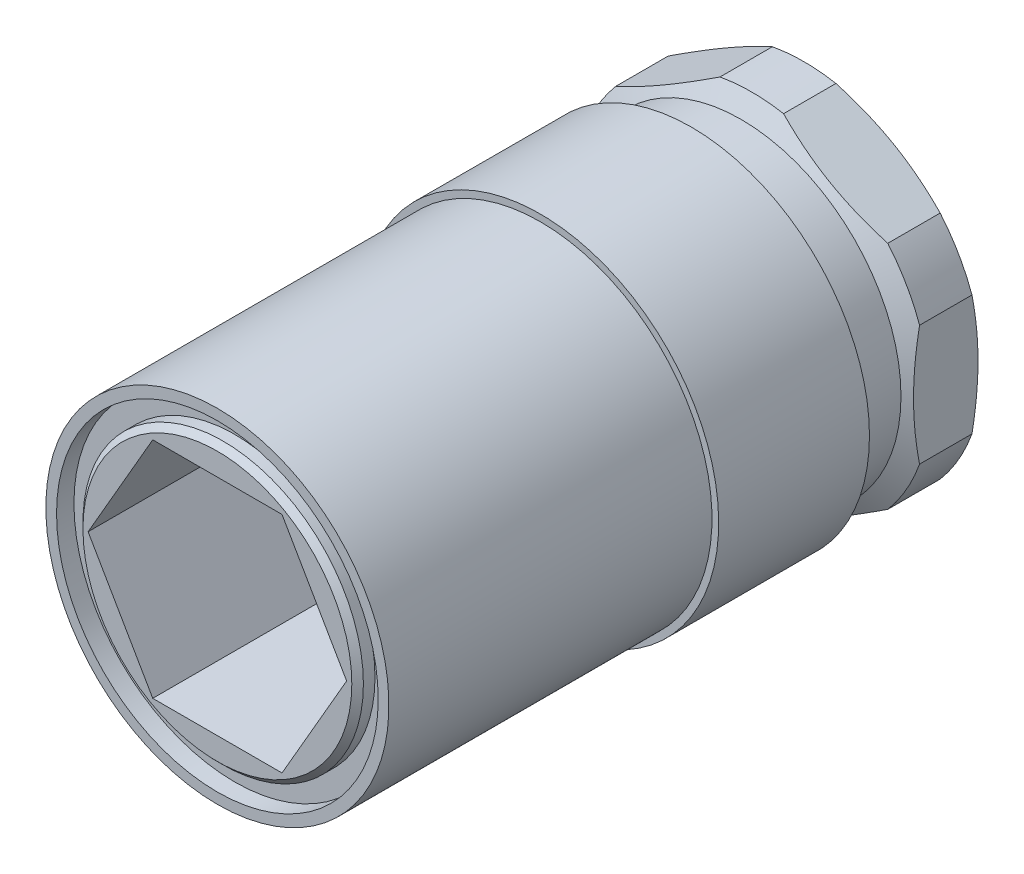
ISO-10303-21;
HEADER;
FILE_DESCRIPTION(('STEP AP214'),'2;1');
FILE_NAME('part.step','',(''),(''),'','','');
FILE_SCHEMA(('AUTOMOTIVE_DESIGN { 1 0 10303 214 1 1 1 1 }'));
ENDSEC;
DATA;
#1=APPLICATION_CONTEXT('core data for automotive mechanical design processes');
#2=APPLICATION_PROTOCOL_DEFINITION('international standard','automotive_design',2000,#1);
#3=PRODUCT_CONTEXT('',#1,'mechanical');
#4=PRODUCT('Part','Part','',(#3));
#5=PRODUCT_RELATED_PRODUCT_CATEGORY('part','',(#4));
#6=PRODUCT_DEFINITION_FORMATION('','',#4);
#7=PRODUCT_DEFINITION_CONTEXT('part definition',#1,'design');
#8=PRODUCT_DEFINITION('design','',#6,#7);
#9=PRODUCT_DEFINITION_SHAPE('','',#8);
#10=(LENGTH_UNIT() NAMED_UNIT(*) SI_UNIT(.MILLI.,.METRE.));
#11=(NAMED_UNIT(*) PLANE_ANGLE_UNIT() SI_UNIT($,.RADIAN.));
#12=(NAMED_UNIT(*) SI_UNIT($,.STERADIAN.) SOLID_ANGLE_UNIT());
#13=UNCERTAINTY_MEASURE_WITH_UNIT(LENGTH_MEASURE(1.E-05),#10,'distance_accuracy_value','');
#14=(GEOMETRIC_REPRESENTATION_CONTEXT(3) GLOBAL_UNCERTAINTY_ASSIGNED_CONTEXT((#13)) GLOBAL_UNIT_ASSIGNED_CONTEXT((#10,
#11,#12)) REPRESENTATION_CONTEXT('',''));
#15=CARTESIAN_POINT('',(0.,0.,0.));
#16=DIRECTION('',(0.,0.,1.));
#17=DIRECTION('',(1.,0.,0.));
#18=AXIS2_PLACEMENT_3D('',#15,#16,#17);
#19=CARTESIAN_POINT('',(0.,0.,-51.5112));
#20=DIRECTION('',(0.,0.,1.));
#21=DIRECTION('',(1.,0.,0.));
#22=AXIS2_PLACEMENT_3D('',#19,#20,#21);
#23=CYLINDRICAL_SURFACE('',#22,15.367);
#24=CARTESIAN_POINT('',(0.,0.,-40.8559));
#25=DIRECTION('',(0.,0.,-1.));
#26=DIRECTION('',(-1.,0.,0.));
#27=AXIS2_PLACEMENT_3D('',#24,#25,#26);
#28=CIRCLE('',#27,15.367);
#29=CARTESIAN_POINT('',(-15.367,0.,-40.8559));
#30=VERTEX_POINT('',#29);
#31=EDGE_CURVE('E390',#30,#30,#28,.F.);
#32=ORIENTED_EDGE('',*,*,#31,.T.);
#33=EDGE_LOOP('',(#32));
#34=FACE_BOUND('',#33,.T.);
#35=CARTESIAN_POINT('',(0.,0.,-27.8559));
#36=DIRECTION('',(0.,0.,1.));
#37=DIRECTION('',(0.,-1.,0.));
#38=AXIS2_PLACEMENT_3D('',#35,#36,#37);
#39=CIRCLE('',#38,15.367);
#40=CARTESIAN_POINT('',(0.,-15.367,-27.8559));
#41=VERTEX_POINT('',#40);
#42=EDGE_CURVE('E211',#41,#41,#39,.T.);
#43=ORIENTED_EDGE('',*,*,#42,.F.);
#44=EDGE_LOOP('',(#43));
#45=FACE_BOUND('',#44,.T.);
#46=ADVANCED_FACE('F36',(#34,#45),#23,.T.);
#47=DIRECTION('',(0.,0.,1.));
#48=VECTOR('',#47,1.);
#49=CARTESIAN_POINT('',(14.4653,5.18650025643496,-51.5112));
#50=LINE('',#49,#48);
#51=CARTESIAN_POINT('',(14.4653,5.18650025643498,-46.0777435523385));
#52=VERTEX_POINT('',#51);
#53=CARTESIAN_POINT('',(14.4653,5.18650025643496,-50.5946564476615));
#54=VERTEX_POINT('',#53);
#55=EDGE_CURVE('E381',#52,#54,#50,.F.);
#56=ORIENTED_EDGE('',*,*,#55,.T.);
#57=CARTESIAN_POINT('',(0.,0.,-50.5946564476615));
#58=DIRECTION('',(0.,0.,1.));
#59=DIRECTION('',(1.,0.,0.));
#60=AXIS2_PLACEMENT_3D('',#57,#58,#59);
#61=CIRCLE('',#60,15.367);
#62=CARTESIAN_POINT('',(11.7242909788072,9.93406714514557,-50.5946564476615));
#63=VERTEX_POINT('',#62);
#64=EDGE_CURVE('E60',#54,#63,#61,.T.);
#65=ORIENTED_EDGE('',*,*,#64,.T.);
#66=DIRECTION('',(0.,0.,1.));
#67=VECTOR('',#66,1.);
#68=CARTESIAN_POINT('',(11.7242909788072,9.93406714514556,-51.5112));
#69=LINE('',#68,#67);
#70=CARTESIAN_POINT('',(11.7242909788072,9.93406714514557,-46.0777435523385));
#71=VERTEX_POINT('',#70);
#72=EDGE_CURVE('E379',#63,#71,#69,.T.);
#73=ORIENTED_EDGE('',*,*,#72,.T.);
#74=CARTESIAN_POINT('',(0.,0.,-46.0777435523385));
#75=DIRECTION('',(0.,0.,-1.));
#76=DIRECTION('',(-1.,0.,0.));
#77=AXIS2_PLACEMENT_3D('',#74,#75,#76);
#78=CIRCLE('',#77,15.367);
#79=EDGE_CURVE('E307',#71,#52,#78,.T.);
#80=ORIENTED_EDGE('',*,*,#79,.T.);
#81=EDGE_LOOP('',(#56,#65,#73,#80));
#82=FACE_BOUND('',#81,.T.);
#83=ADVANCED_FACE('F352',(#82),#23,.T.);
#84=DIRECTION('',(0.,0.,1.));
#85=VECTOR('',#84,1.);
#86=CARTESIAN_POINT('',(2.74100902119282,15.1205674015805,-51.5112));
#87=LINE('',#86,#85);
#88=CARTESIAN_POINT('',(2.74100902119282,15.1205674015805,-46.0777435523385));
#89=VERTEX_POINT('',#88);
#90=CARTESIAN_POINT('',(2.74100902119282,15.1205674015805,-50.5946564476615));
#91=VERTEX_POINT('',#90);
#92=EDGE_CURVE('E375',#89,#91,#87,.F.);
#93=ORIENTED_EDGE('',*,*,#92,.T.);
#94=CARTESIAN_POINT('',(0.,0.,-50.5946564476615));
#95=DIRECTION('',(0.,0.,1.));
#96=DIRECTION('',(1.,0.,0.));
#97=AXIS2_PLACEMENT_3D('',#94,#95,#96);
#98=CIRCLE('',#97,15.367);
#99=CARTESIAN_POINT('',(-2.74100902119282,15.1205674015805,-50.5946564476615));
#100=VERTEX_POINT('',#99);
#101=EDGE_CURVE('E376',#91,#100,#98,.T.);
#102=ORIENTED_EDGE('',*,*,#101,.T.);
#103=DIRECTION('',(0.,0.,1.));
#104=VECTOR('',#103,1.);
#105=CARTESIAN_POINT('',(-2.74100902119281,15.1205674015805,-51.5112));
#106=LINE('',#105,#104);
#107=CARTESIAN_POINT('',(-2.74100902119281,15.1205674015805,-46.0777435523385));
#108=VERTEX_POINT('',#107);
#109=EDGE_CURVE('E458',#100,#108,#106,.T.);
#110=ORIENTED_EDGE('',*,*,#109,.T.);
#111=CARTESIAN_POINT('',(0.,0.,-46.0777435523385));
#112=DIRECTION('',(0.,0.,-1.));
#113=DIRECTION('',(-1.,0.,0.));
#114=AXIS2_PLACEMENT_3D('',#111,#112,#113);
#115=CIRCLE('',#114,15.367);
#116=EDGE_CURVE('E327',#108,#89,#115,.T.);
#117=ORIENTED_EDGE('',*,*,#116,.T.);
#118=EDGE_LOOP('',(#93,#102,#110,#117));
#119=FACE_BOUND('',#118,.T.);
#120=ADVANCED_FACE('F355',(#119),#23,.T.);
#121=DIRECTION('',(0.,0.,1.));
#122=VECTOR('',#121,1.);
#123=CARTESIAN_POINT('',(-11.7242909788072,9.93406714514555,-51.5112));
#124=LINE('',#123,#122);
#125=CARTESIAN_POINT('',(-11.7242909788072,9.93406714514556,-46.0777435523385));
#126=VERTEX_POINT('',#125);
#127=CARTESIAN_POINT('',(-11.7242909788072,9.93406714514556,-50.5946564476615));
#128=VERTEX_POINT('',#127);
#129=EDGE_CURVE('E383',#126,#128,#124,.F.);
#130=ORIENTED_EDGE('',*,*,#129,.T.);
#131=CARTESIAN_POINT('',(0.,0.,-50.5946564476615));
#132=DIRECTION('',(0.,0.,1.));
#133=DIRECTION('',(1.,0.,0.));
#134=AXIS2_PLACEMENT_3D('',#131,#132,#133);
#135=CIRCLE('',#134,15.367);
#136=CARTESIAN_POINT('',(-14.4653,5.18650025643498,-50.5946564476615));
#137=VERTEX_POINT('',#136);
#138=EDGE_CURVE('E462',#128,#137,#135,.T.);
#139=ORIENTED_EDGE('',*,*,#138,.T.);
#140=DIRECTION('',(0.,0.,1.));
#141=VECTOR('',#140,1.);
#142=CARTESIAN_POINT('',(-14.4653,5.18650025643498,-51.5112));
#143=LINE('',#142,#141);
#144=CARTESIAN_POINT('',(-14.4653,5.18650025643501,-46.0777435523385));
#145=VERTEX_POINT('',#144);
#146=EDGE_CURVE('E453',#137,#145,#143,.T.);
#147=ORIENTED_EDGE('',*,*,#146,.T.);
#148=CARTESIAN_POINT('',(0.,0.,-46.0777435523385));
#149=DIRECTION('',(0.,0.,-1.));
#150=DIRECTION('',(-1.,0.,0.));
#151=AXIS2_PLACEMENT_3D('',#148,#149,#150);
#152=CIRCLE('',#151,15.367);
#153=EDGE_CURVE('E336',#145,#126,#152,.T.);
#154=ORIENTED_EDGE('',*,*,#153,.T.);
#155=EDGE_LOOP('',(#130,#139,#147,#154));
#156=FACE_BOUND('',#155,.T.);
#157=ADVANCED_FACE('F365',(#156),#23,.T.);
#158=DIRECTION('',(0.,0.,1.));
#159=VECTOR('',#158,1.);
#160=CARTESIAN_POINT('',(-14.4653,-5.18650025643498,-51.5112));
#161=LINE('',#160,#159);
#162=CARTESIAN_POINT('',(-14.4653,-5.18650025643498,-46.0777435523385));
#163=VERTEX_POINT('',#162);
#164=CARTESIAN_POINT('',(-14.4653,-5.18650025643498,-50.5946564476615));
#165=VERTEX_POINT('',#164);
#166=EDGE_CURVE('E455',#163,#165,#161,.F.);
#167=ORIENTED_EDGE('',*,*,#166,.T.);
#168=CARTESIAN_POINT('',(0.,0.,-50.5946564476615));
#169=DIRECTION('',(0.,0.,1.));
#170=DIRECTION('',(1.,0.,0.));
#171=AXIS2_PLACEMENT_3D('',#168,#169,#170);
#172=CIRCLE('',#171,15.367);
#173=CARTESIAN_POINT('',(-11.7242909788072,-9.93406714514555,-50.5946564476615));
#174=VERTEX_POINT('',#173);
#175=EDGE_CURVE('E287',#165,#174,#172,.T.);
#176=ORIENTED_EDGE('',*,*,#175,.T.);
#177=DIRECTION('',(0.,0.,1.));
#178=VECTOR('',#177,1.);
#179=CARTESIAN_POINT('',(-11.7242909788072,-9.93406714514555,-51.5112));
#180=LINE('',#179,#178);
#181=CARTESIAN_POINT('',(-11.7242909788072,-9.93406714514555,-46.0777435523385));
#182=VERTEX_POINT('',#181);
#183=EDGE_CURVE('E448',#174,#182,#180,.T.);
#184=ORIENTED_EDGE('',*,*,#183,.T.);
#185=CARTESIAN_POINT('',(0.,0.,-46.0777435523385));
#186=DIRECTION('',(0.,0.,-1.));
#187=DIRECTION('',(-1.,0.,0.));
#188=AXIS2_PLACEMENT_3D('',#185,#186,#187);
#189=CIRCLE('',#188,15.367);
#190=EDGE_CURVE('E318',#182,#163,#189,.T.);
#191=ORIENTED_EDGE('',*,*,#190,.T.);
#192=EDGE_LOOP('',(#167,#176,#184,#191));
#193=FACE_BOUND('',#192,.T.);
#194=ADVANCED_FACE('F370',(#193),#23,.T.);
#195=DIRECTION('',(0.,0.,1.));
#196=VECTOR('',#195,1.);
#197=CARTESIAN_POINT('',(-2.74100902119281,-15.1205674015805,-51.5112));
#198=LINE('',#197,#196);
#199=CARTESIAN_POINT('',(-2.74100902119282,-15.1205674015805,-46.0777435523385));
#200=VERTEX_POINT('',#199);
#201=CARTESIAN_POINT('',(-2.74100902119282,-15.1205674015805,-50.5946564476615));
#202=VERTEX_POINT('',#201);
#203=EDGE_CURVE('E450',#200,#202,#198,.F.);
#204=ORIENTED_EDGE('',*,*,#203,.T.);
#205=CARTESIAN_POINT('',(0.,0.,-50.5946564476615));
#206=DIRECTION('',(0.,0.,1.));
#207=DIRECTION('',(1.,0.,0.));
#208=AXIS2_PLACEMENT_3D('',#205,#206,#207);
#209=CIRCLE('',#208,15.367);
#210=CARTESIAN_POINT('',(2.74100902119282,-15.1205674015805,-50.5946564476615));
#211=VERTEX_POINT('',#210);
#212=EDGE_CURVE('E466',#202,#211,#209,.T.);
#213=ORIENTED_EDGE('',*,*,#212,.T.);
#214=DIRECTION('',(0.,0.,1.));
#215=VECTOR('',#214,1.);
#216=CARTESIAN_POINT('',(2.74100902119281,-15.1205674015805,-51.5112));
#217=LINE('',#216,#215);
#218=CARTESIAN_POINT('',(2.74100902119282,-15.1205674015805,-46.0777435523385));
#219=VERTEX_POINT('',#218);
#220=EDGE_CURVE('E391',#211,#219,#217,.T.);
#221=ORIENTED_EDGE('',*,*,#220,.T.);
#222=CARTESIAN_POINT('',(0.,0.,-46.0777435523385));
#223=DIRECTION('',(0.,0.,-1.));
#224=DIRECTION('',(-1.,0.,0.));
#225=AXIS2_PLACEMENT_3D('',#222,#223,#224);
#226=CIRCLE('',#225,15.367);
#227=EDGE_CURVE('E308',#219,#200,#226,.T.);
#228=ORIENTED_EDGE('',*,*,#227,.T.);
#229=EDGE_LOOP('',(#204,#213,#221,#228));
#230=FACE_BOUND('',#229,.T.);
#231=ADVANCED_FACE('F740',(#230),#23,.T.);
#232=DIRECTION('',(0.,0.,1.));
#233=VECTOR('',#232,1.);
#234=CARTESIAN_POINT('',(11.7242909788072,-9.93406714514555,-51.5112));
#235=LINE('',#234,#233);
#236=CARTESIAN_POINT('',(11.7242909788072,-9.93406714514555,-46.0777435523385));
#237=VERTEX_POINT('',#236);
#238=CARTESIAN_POINT('',(11.7242909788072,-9.93406714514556,-50.5946564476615));
#239=VERTEX_POINT('',#238);
#240=EDGE_CURVE('E446',#237,#239,#235,.F.);
#241=ORIENTED_EDGE('',*,*,#240,.T.);
#242=CARTESIAN_POINT('',(0.,0.,-50.5946564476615));
#243=DIRECTION('',(0.,0.,1.));
#244=DIRECTION('',(1.,0.,0.));
#245=AXIS2_PLACEMENT_3D('',#242,#243,#244);
#246=CIRCLE('',#245,15.367);
#247=CARTESIAN_POINT('',(14.4653,-5.18650025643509,-50.5946564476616));
#248=VERTEX_POINT('',#247);
#249=EDGE_CURVE('E226',#239,#248,#246,.T.);
#250=ORIENTED_EDGE('',*,*,#249,.T.);
#251=DIRECTION('',(0.,0.,1.));
#252=VECTOR('',#251,1.);
#253=CARTESIAN_POINT('',(14.4653,-5.18650025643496,-51.5112));
#254=LINE('',#253,#252);
#255=CARTESIAN_POINT('',(14.4653,-5.18650025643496,-46.0777435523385));
#256=VERTEX_POINT('',#255);
#257=EDGE_CURVE('E378',#248,#256,#254,.T.);
#258=ORIENTED_EDGE('',*,*,#257,.T.);
#259=CARTESIAN_POINT('',(0.,0.,-46.0777435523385));
#260=DIRECTION('',(0.,0.,-1.));
#261=DIRECTION('',(-1.,0.,0.));
#262=AXIS2_PLACEMENT_3D('',#259,#260,#261);
#263=CIRCLE('',#262,15.367);
#264=EDGE_CURVE('E389',#256,#237,#263,.T.);
#265=ORIENTED_EDGE('',*,*,#264,.T.);
#266=EDGE_LOOP('',(#241,#250,#258,#265));
#267=FACE_BOUND('',#266,.T.);
#268=ADVANCED_FACE('F360',(#267),#23,.T.);
#269=CARTESIAN_POINT('',(14.4653,-8.35154484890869,-45.1612));
#270=DIRECTION('',(0.5,-0.866025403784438,0.));
#271=DIRECTION('',(0.866025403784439,0.5,0.));
#272=AXIS2_PLACEMENT_3D('',#269,#270,#271);
#273=PLANE('',#272);
#274=ORIENTED_EDGE('',*,*,#220,.F.);
#275=CARTESIAN_POINT('',(2.74080902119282,-15.1206828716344,-50.5946114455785));
#276=CARTESIAN_POINT('',(3.03935722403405,-14.9483159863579,-50.6618133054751));
#277=CARTESIAN_POINT('',(3.33890826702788,-14.7753701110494,-50.723260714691));
#278=CARTESIAN_POINT('',(3.93979291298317,-14.4284491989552,-50.8336982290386));
#279=CARTESIAN_POINT('',(4.24112690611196,-14.2544739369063,-50.8826854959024));
#280=CARTESIAN_POINT('',(4.84532947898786,-13.9056374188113,-50.9672384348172));
#281=CARTESIAN_POINT('',(5.14819858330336,-13.7307758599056,-51.0027991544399));
#282=CARTESIAN_POINT('',(5.75491480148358,-13.3804880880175,-51.0597317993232));
#283=CARTESIAN_POINT('',(6.05876182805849,-13.205061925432,-51.0811049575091));
#284=CARTESIAN_POINT('',(6.66238083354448,-12.8565623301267,-51.10897792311));
#285=CARTESIAN_POINT('',(6.96214517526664,-12.6834933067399,-51.1156971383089));
#286=CARTESIAN_POINT('',(7.56167186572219,-12.3373564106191,-51.1147636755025));
#287=CARTESIAN_POINT('',(7.86143421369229,-12.1642885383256,-51.1071103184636));
#288=CARTESIAN_POINT('',(8.46025747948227,-11.8185577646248,-51.077609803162));
#289=CARTESIAN_POINT('',(8.75931870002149,-11.6458946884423,-51.0557707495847));
#290=CARTESIAN_POINT('',(9.35642256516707,-11.3011566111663,-50.9983778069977));
#291=CARTESIAN_POINT('',(9.65446531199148,-11.1290815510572,-50.962825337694));
#292=CARTESIAN_POINT('',(10.1000359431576,-10.8718312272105,-50.8998183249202));
#293=CARTESIAN_POINT('',(10.2480953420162,-10.7863490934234,-50.8772429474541));
#294=CARTESIAN_POINT('',(10.5438158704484,-10.6156147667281,-50.828975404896));
#295=CARTESIAN_POINT('',(10.691477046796,-10.530362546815,-50.8032836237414));
#296=CARTESIAN_POINT('',(10.9869545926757,-10.3597685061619,-50.7487899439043));
#297=CARTESIAN_POINT('',(11.1347693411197,-10.2744276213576,-50.7199763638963));
#298=CARTESIAN_POINT('',(11.4299651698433,-10.1039962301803,-50.6594425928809));
#299=CARTESIAN_POINT('',(11.5773462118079,-10.0189057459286,-50.6277221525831));
#300=CARTESIAN_POINT('',(11.7244909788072,-9.93395167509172,-50.5946114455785));
#301=B_SPLINE_CURVE_WITH_KNOTS('',3,(#275,#276,#277,#278,#279,#280,#281,#282,#283,#284,#285,
#286,#287,#288,#289,#290,#291,#292,#293,#294,#295,#296,#297,#298,#299,#300),.UNSPECIFIED.,.F.,
.F.,(4,2,2,2,2,2,2,2,2,2,2,2,4),(0.,1.05367254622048,2.10758489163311,3.16188559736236,
4.21609467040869,5.25440789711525,6.29277018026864,7.33053973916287,8.36820188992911,
8.88552354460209,9.40278153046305,9.92204662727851,10.441356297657),.UNSPECIFIED.);
#302=EDGE_CURVE('E238',#211,#239,#301,.T.);
#303=ORIENTED_EDGE('',*,*,#302,.T.);
#304=ORIENTED_EDGE('',*,*,#240,.F.);
#305=CARTESIAN_POINT('',(11.7244909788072,-9.93395167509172,-46.0777885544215));
#306=CARTESIAN_POINT('',(11.425942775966,-10.1063185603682,-46.0105866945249));
#307=CARTESIAN_POINT('',(11.1263917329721,-10.2792644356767,-45.949139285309));
#308=CARTESIAN_POINT('',(10.5255070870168,-10.6261853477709,-45.8387017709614));
#309=CARTESIAN_POINT('',(10.224173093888,-10.8001606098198,-45.7897145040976));
#310=CARTESIAN_POINT('',(9.61997052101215,-11.1489971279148,-45.7051615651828));
#311=CARTESIAN_POINT('',(9.31710141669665,-11.3238586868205,-45.66960084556));
#312=CARTESIAN_POINT('',(8.71038519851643,-11.6741464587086,-45.6126682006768));
#313=CARTESIAN_POINT('',(8.40653817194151,-11.8495726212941,-45.5912950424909));
#314=CARTESIAN_POINT('',(7.80291916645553,-12.1980722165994,-45.56342207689));
#315=CARTESIAN_POINT('',(7.50315482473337,-12.3711412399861,-45.5567028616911));
#316=CARTESIAN_POINT('',(6.90362813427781,-12.717278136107,-45.5576363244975));
#317=CARTESIAN_POINT('',(6.60386578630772,-12.8903460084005,-45.5652896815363));
#318=CARTESIAN_POINT('',(6.00504252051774,-13.2360767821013,-45.594790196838));
#319=CARTESIAN_POINT('',(5.70598129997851,-13.4087398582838,-45.6166292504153));
#320=CARTESIAN_POINT('',(5.10887743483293,-13.7534779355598,-45.6740221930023));
#321=CARTESIAN_POINT('',(4.81083468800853,-13.9255529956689,-45.709574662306));
#322=CARTESIAN_POINT('',(4.36526405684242,-14.1828033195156,-45.7725816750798));
#323=CARTESIAN_POINT('',(4.21720465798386,-14.2682854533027,-45.7951570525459));
#324=CARTESIAN_POINT('',(3.92148412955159,-14.4390197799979,-45.843424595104));
#325=CARTESIAN_POINT('',(3.773822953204,-14.5242719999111,-45.8691163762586));
#326=CARTESIAN_POINT('',(3.47834540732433,-14.6948660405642,-45.9236100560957));
#327=CARTESIAN_POINT('',(3.33053065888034,-14.7802069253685,-45.9524236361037));
#328=CARTESIAN_POINT('',(3.03533483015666,-14.9506383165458,-46.0129574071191));
#329=CARTESIAN_POINT('',(2.88795378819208,-15.0357288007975,-46.0446778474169));
#330=CARTESIAN_POINT('',(2.74080902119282,-15.1206828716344,-46.0777885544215));
#331=B_SPLINE_CURVE_WITH_KNOTS('',3,(#305,#306,#307,#308,#309,#310,#311,#312,#313,#314,#315,
#316,#317,#318,#319,#320,#321,#322,#323,#324,#325,#326,#327,#328,#329,#330),.UNSPECIFIED.,.F.,
.F.,(4,2,2,2,2,2,2,2,2,2,2,2,4),(0.,1.05367254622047,2.10758489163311,3.16188559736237,
4.21609467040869,5.25440789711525,6.29277018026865,7.33053973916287,8.36820188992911,
8.8855235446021,9.40278153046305,9.92204662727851,10.441356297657),.UNSPECIFIED.);
#332=EDGE_CURVE('E477',#237,#219,#331,.T.);
#333=ORIENTED_EDGE('',*,*,#332,.T.);
#334=EDGE_LOOP('',(#274,#303,#304,#333));
#335=FACE_BOUND('',#334,.T.);
#336=ADVANCED_FACE('F294',(#335),#273,.T.);
#337=CARTESIAN_POINT('',(0.,-16.7030896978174,-45.1612));
#338=DIRECTION('',(-0.5,-0.866025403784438,0.));
#339=DIRECTION('',(0.866025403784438,-0.5,0.));
#340=AXIS2_PLACEMENT_3D('',#337,#338,#339);
#341=PLANE('',#340);
#342=ORIENTED_EDGE('',*,*,#183,.F.);
#343=CARTESIAN_POINT('',(-11.7244909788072,-9.93395167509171,-50.5946114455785));
#344=CARTESIAN_POINT('',(-11.425942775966,-10.1063185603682,-50.6618133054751));
#345=CARTESIAN_POINT('',(-11.1263917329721,-10.2792644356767,-50.723260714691));
#346=CARTESIAN_POINT('',(-10.5255070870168,-10.6261853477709,-50.8336982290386));
#347=CARTESIAN_POINT('',(-10.224173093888,-10.8001606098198,-50.8826854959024));
#348=CARTESIAN_POINT('',(-9.61997052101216,-11.1489971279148,-50.9672384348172));
#349=CARTESIAN_POINT('',(-9.31710141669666,-11.3238586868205,-51.0027991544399));
#350=CARTESIAN_POINT('',(-8.71038519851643,-11.6741464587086,-51.0597317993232));
#351=CARTESIAN_POINT('',(-8.40653817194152,-11.8495726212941,-51.0811049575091));
#352=CARTESIAN_POINT('',(-7.80291916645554,-12.1980722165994,-51.10897792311));
#353=CARTESIAN_POINT('',(-7.50315482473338,-12.3711412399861,-51.1156971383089));
#354=CARTESIAN_POINT('',(-6.90362813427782,-12.717278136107,-51.1147636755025));
#355=CARTESIAN_POINT('',(-6.60386578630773,-12.8903460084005,-51.1071103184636));
#356=CARTESIAN_POINT('',(-6.00504252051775,-13.2360767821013,-51.077609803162));
#357=CARTESIAN_POINT('',(-5.70598129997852,-13.4087398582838,-51.0557707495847));
#358=CARTESIAN_POINT('',(-5.10887743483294,-13.7534779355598,-50.9983778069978));
#359=CARTESIAN_POINT('',(-4.81083468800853,-13.9255529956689,-50.962825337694));
#360=CARTESIAN_POINT('',(-4.36526405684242,-14.1828033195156,-50.8998183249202));
#361=CARTESIAN_POINT('',(-4.21720465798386,-14.2682854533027,-50.8772429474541));
#362=CARTESIAN_POINT('',(-3.9214841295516,-14.4390197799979,-50.828975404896));
#363=CARTESIAN_POINT('',(-3.773822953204,-14.5242719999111,-50.8032836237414));
#364=CARTESIAN_POINT('',(-3.47834540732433,-14.6948660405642,-50.7487899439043));
#365=CARTESIAN_POINT('',(-3.33053065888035,-14.7802069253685,-50.7199763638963));
#366=CARTESIAN_POINT('',(-3.03533483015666,-14.9506383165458,-50.6594425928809));
#367=CARTESIAN_POINT('',(-2.88795378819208,-15.0357288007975,-50.6277221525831));
#368=CARTESIAN_POINT('',(-2.74080902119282,-15.1206828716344,-50.5946114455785));
#369=B_SPLINE_CURVE_WITH_KNOTS('',3,(#343,#344,#345,#346,#347,#348,#349,#350,#351,#352,#353,
#354,#355,#356,#357,#358,#359,#360,#361,#362,#363,#364,#365,#366,#367,#368),.UNSPECIFIED.,.F.,
.F.,(4,2,2,2,2,2,2,2,2,2,2,2,4),(0.,1.05367254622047,2.10758489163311,3.16188559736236,
4.21609467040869,5.25440789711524,6.29277018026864,7.33053973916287,8.36820188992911,
8.8855235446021,9.40278153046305,9.92204662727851,10.441356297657),.UNSPECIFIED.);
#370=EDGE_CURVE('E280',#174,#202,#369,.T.);
#371=ORIENTED_EDGE('',*,*,#370,.T.);
#372=ORIENTED_EDGE('',*,*,#203,.F.);
#373=CARTESIAN_POINT('',(-2.74080902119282,-15.1206828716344,-46.0777885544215));
#374=CARTESIAN_POINT('',(-3.03935722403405,-14.9483159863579,-46.0105866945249));
#375=CARTESIAN_POINT('',(-3.33890826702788,-14.7753701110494,-45.949139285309));
#376=CARTESIAN_POINT('',(-3.93979291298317,-14.4284491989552,-45.8387017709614));
#377=CARTESIAN_POINT('',(-4.24112690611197,-14.2544739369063,-45.7897145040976));
#378=CARTESIAN_POINT('',(-4.84532947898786,-13.9056374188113,-45.7051615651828));
#379=CARTESIAN_POINT('',(-5.14819858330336,-13.7307758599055,-45.6696008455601));
#380=CARTESIAN_POINT('',(-5.75491480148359,-13.3804880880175,-45.6126682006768));
#381=CARTESIAN_POINT('',(-6.0587618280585,-13.205061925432,-45.5912950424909));
#382=CARTESIAN_POINT('',(-6.66238083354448,-12.8565623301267,-45.56342207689));
#383=CARTESIAN_POINT('',(-6.96214517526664,-12.6834933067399,-45.5567028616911));
#384=CARTESIAN_POINT('',(-7.56167186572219,-12.3373564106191,-45.5576363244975));
#385=CARTESIAN_POINT('',(-7.86143421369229,-12.1642885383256,-45.5652896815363));
#386=CARTESIAN_POINT('',(-8.46025747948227,-11.8185577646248,-45.594790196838));
#387=CARTESIAN_POINT('',(-8.75931870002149,-11.6458946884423,-45.6166292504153));
#388=CARTESIAN_POINT('',(-9.35642256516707,-11.3011566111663,-45.6740221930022));
#389=CARTESIAN_POINT('',(-9.65446531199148,-11.1290815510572,-45.709574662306));
#390=CARTESIAN_POINT('',(-10.1000359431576,-10.8718312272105,-45.7725816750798));
#391=CARTESIAN_POINT('',(-10.2480953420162,-10.7863490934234,-45.7951570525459));
#392=CARTESIAN_POINT('',(-10.5438158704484,-10.6156147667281,-45.843424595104));
#393=CARTESIAN_POINT('',(-10.691477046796,-10.530362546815,-45.8691163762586));
#394=CARTESIAN_POINT('',(-10.9869545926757,-10.3597685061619,-45.9236100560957));
#395=CARTESIAN_POINT('',(-11.1347693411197,-10.2744276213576,-45.9524236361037));
#396=CARTESIAN_POINT('',(-11.4299651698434,-10.1039962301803,-46.0129574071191));
#397=CARTESIAN_POINT('',(-11.5773462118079,-10.0189057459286,-46.0446778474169));
#398=CARTESIAN_POINT('',(-11.7244909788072,-9.93395167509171,-46.0777885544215));
#399=B_SPLINE_CURVE_WITH_KNOTS('',3,(#373,#374,#375,#376,#377,#378,#379,#380,#381,#382,#383,
#384,#385,#386,#387,#388,#389,#390,#391,#392,#393,#394,#395,#396,#397,#398),.UNSPECIFIED.,.F.,
.F.,(4,2,2,2,2,2,2,2,2,2,2,2,4),(0.,1.05367254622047,2.10758489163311,3.16188559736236,
4.21609467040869,5.25440789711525,6.29277018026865,7.33053973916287,8.36820188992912,
8.8855235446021,9.40278153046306,9.92204662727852,10.441356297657),.UNSPECIFIED.);
#400=EDGE_CURVE('E300',#200,#182,#399,.T.);
#401=ORIENTED_EDGE('',*,*,#400,.T.);
#402=EDGE_LOOP('',(#342,#371,#372,#401));
#403=FACE_BOUND('',#402,.T.);
#404=ADVANCED_FACE('F289',(#403),#341,.T.);
#405=CARTESIAN_POINT('',(-14.4653,-8.35154484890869,-45.1612));
#406=DIRECTION('',(-1.,0.,0.));
#407=DIRECTION('',(0.,0.,1.));
#408=AXIS2_PLACEMENT_3D('',#405,#406,#407);
#409=PLANE('',#408);
#410=ORIENTED_EDGE('',*,*,#146,.F.);
#411=CARTESIAN_POINT('',(-14.4653,-16.9712106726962,-46.5921861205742));
#412=CARTESIAN_POINT('',(-14.4653,-16.7083945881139,-46.7076638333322));
#413=CARTESIAN_POINT('',(-14.4653,-16.4451654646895,-46.8222006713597));
#414=CARTESIAN_POINT('',(-14.4653,-15.9178066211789,-47.0491955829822));
#415=CARTESIAN_POINT('',(-14.4653,-15.6536768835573,-47.1616536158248));
#416=CARTESIAN_POINT('',(-14.4653,-14.8597109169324,-47.4956617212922));
#417=CARTESIAN_POINT('',(-14.4653,-14.3284265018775,-47.7137890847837));
#418=CARTESIAN_POINT('',(-14.4653,-13.2583314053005,-48.1401707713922));
#419=CARTESIAN_POINT('',(-14.4653,-12.7194949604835,-48.3483606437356));
#420=CARTESIAN_POINT('',(-14.4653,-11.6367190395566,-48.7509750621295));
#421=CARTESIAN_POINT('',(-14.4653,-11.0927799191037,-48.9454005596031));
#422=CARTESIAN_POINT('',(-14.4653,-10.0079353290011,-49.3143815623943));
#423=CARTESIAN_POINT('',(-14.4653,-9.46712210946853,-49.4892066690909));
#424=CARTESIAN_POINT('',(-14.4653,-8.37936329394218,-49.8189241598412));
#425=CARTESIAN_POINT('',(-14.4653,-7.83241730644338,-49.9738152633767));
#426=CARTESIAN_POINT('',(-14.4653,-6.73338426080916,-50.2591374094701));
#427=CARTESIAN_POINT('',(-14.4653,-6.18131080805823,-50.3896204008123));
#428=CARTESIAN_POINT('',(-14.4653,-5.07118171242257,-50.6219389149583));
#429=CARTESIAN_POINT('',(-14.4653,-4.5131273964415,-50.7237806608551));
#430=CARTESIAN_POINT('',(-14.4653,-3.61668571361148,-50.8602074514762));
#431=CARTESIAN_POINT('',(-14.4653,-3.27989348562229,-50.905389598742));
#432=CARTESIAN_POINT('',(-14.4653,-2.60485768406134,-50.9830711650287));
#433=CARTESIAN_POINT('',(-14.4653,-2.26661421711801,-51.0155715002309));
#434=CARTESIAN_POINT('',(-14.4653,-1.58904620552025,-51.0672507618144));
#435=CARTESIAN_POINT('',(-14.4653,-1.24972147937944,-51.0864273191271));
#436=CARTESIAN_POINT('',(-14.4653,-0.570567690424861,-51.1110494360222));
#437=CARTESIAN_POINT('',(-14.4653,-0.230738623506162,-51.1164948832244));
#438=CARTESIAN_POINT('',(-14.4653,0.450018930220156,-51.113531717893));
#439=CARTESIAN_POINT('',(-14.4653,0.790947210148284,-51.1050757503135));
#440=CARTESIAN_POINT('',(-14.4653,1.47217855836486,-51.0744028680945));
#441=CARTESIAN_POINT('',(-14.4653,1.81248162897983,-51.0521860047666));
#442=CARTESIAN_POINT('',(-14.4653,2.49182544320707,-50.9944656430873));
#443=CARTESIAN_POINT('',(-14.4653,2.83086660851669,-50.9589670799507));
#444=CARTESIAN_POINT('',(-14.4653,3.50741669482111,-50.8753750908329));
#445=CARTESIAN_POINT('',(-14.4653,3.84492545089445,-50.8272803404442));
#446=CARTESIAN_POINT('',(-14.4653,4.59773039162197,-50.7065819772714));
#447=CARTESIAN_POINT('',(-14.4653,5.01252875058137,-50.6308717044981));
#448=CARTESIAN_POINT('',(-14.4653,5.83888777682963,-50.4633217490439));
#449=CARTESIAN_POINT('',(-14.4653,6.25044795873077,-50.3714796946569));
#450=CARTESIAN_POINT('',(-14.4653,7.07035789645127,-50.173501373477));
#451=CARTESIAN_POINT('',(-14.4653,7.47870557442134,-50.0673565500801));
#452=CARTESIAN_POINT('',(-14.4653,8.29192164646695,-49.8426375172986));
#453=CARTESIAN_POINT('',(-14.4653,8.69679024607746,-49.724064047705));
#454=CARTESIAN_POINT('',(-14.4653,9.50515869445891,-49.4755464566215));
#455=CARTESIAN_POINT('',(-14.4653,9.90864237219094,-49.3455499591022));
#456=CARTESIAN_POINT('',(-14.4653,10.7124577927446,-49.0761845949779));
#457=CARTESIAN_POINT('',(-14.4653,11.1127895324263,-48.9368157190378));
#458=CARTESIAN_POINT('',(-14.4653,11.9104357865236,-48.6500513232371));
#459=CARTESIAN_POINT('',(-14.4653,12.3077510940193,-48.5026580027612));
#460=CARTESIAN_POINT('',(-14.4653,13.0997411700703,-48.2009262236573));
#461=CARTESIAN_POINT('',(-14.4653,13.4944158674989,-48.0465875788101));
#462=CARTESIAN_POINT('',(-14.4653,14.2833766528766,-47.7311210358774));
#463=CARTESIAN_POINT('',(-14.4653,14.6776504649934,-47.5699624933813));
#464=CARTESIAN_POINT('',(-14.4653,15.4640209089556,-47.2424121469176));
#465=CARTESIAN_POINT('',(-14.4653,15.8561175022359,-47.0760202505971));
#466=CARTESIAN_POINT('',(-14.4653,17.0295360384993,-46.5700469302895));
#467=CARTESIAN_POINT('',(-14.4653,17.8079400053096,-46.2236867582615));
#468=CARTESIAN_POINT('',(-14.4653,18.96622482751,-45.6959631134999));
#469=CARTESIAN_POINT('',(-14.4653,19.3484881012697,-45.5197780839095));
#470=CARTESIAN_POINT('',(-14.4653,20.111639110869,-45.1644448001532));
#471=CARTESIAN_POINT('',(-14.4653,20.4925268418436,-44.9852965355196));
#472=CARTESIAN_POINT('',(-14.4653,21.252955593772,-44.6244473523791));
#473=CARTESIAN_POINT('',(-14.4653,21.6324969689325,-44.4427471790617));
#474=CARTESIAN_POINT('',(-14.4653,22.3904573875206,-44.0770355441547));
#475=CARTESIAN_POINT('',(-14.4653,22.7688764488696,-43.8930241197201));
#476=CARTESIAN_POINT('',(-14.4653,23.1467978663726,-43.7079999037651));
#477=B_SPLINE_CURVE_WITH_KNOTS('',3,(#411,#412,#413,#414,#415,#416,#417,#418,#419,#420,#421,
#422,#423,#424,#425,#426,#427,#428,#429,#430,#431,#432,#433,#434,#435,#436,#437,#438,#439,#440,
#441,#442,#443,#444,#445,#446,#447,#448,#449,#450,#451,#452,#453,#454,#455,#456,#457,#458,#459,
#460,#461,#462,#463,#464,#465,#466,#467,#468,#469,#470,#471,#472,#473,#474,#475,#476),
.UNSPECIFIED.,.F.,.F.,(4,2,2,2,2,2,2,2,2,2,2,2,2,2,2,2,2,2,2,2,2,2,2,2,2,2,2,2,2,2,2,2,4),(0.,
0.86119721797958,1.72241130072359,3.44526098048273,5.17808225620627,6.9107836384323,
8.61557687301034,10.320479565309,12.021711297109,13.7225731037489,14.7417933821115,
15.7609400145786,16.7802678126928,17.7996039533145,18.8224196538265,19.8452315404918,
20.867663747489,21.8902034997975,23.1547851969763,24.4195529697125,25.6850807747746,
26.950533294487,28.2221254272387,29.4937188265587,30.76496543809,32.0362461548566,
33.3140185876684,34.5918135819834,37.1475547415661,38.410282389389,39.6730144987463,
40.9353852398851,42.1977357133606),.UNSPECIFIED.);
#478=EDGE_CURVE('E823',#137,#165,#477,.F.);
#479=ORIENTED_EDGE('',*,*,#478,.T.);
#480=ORIENTED_EDGE('',*,*,#166,.F.);
#481=CARTESIAN_POINT('',(-14.4653,-16.9712106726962,-50.0802138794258));
#482=CARTESIAN_POINT('',(-14.4653,-16.7083945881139,-49.9647361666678));
#483=CARTESIAN_POINT('',(-14.4653,-16.4451654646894,-49.8501993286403));
#484=CARTESIAN_POINT('',(-14.4653,-15.9178066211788,-49.6232044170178));
#485=CARTESIAN_POINT('',(-14.4653,-15.6536768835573,-49.5107463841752));
#486=CARTESIAN_POINT('',(-14.4653,-14.8597109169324,-49.1767382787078));
#487=CARTESIAN_POINT('',(-14.4653,-14.3284265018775,-48.9586109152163));
#488=CARTESIAN_POINT('',(-14.4653,-13.2583314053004,-48.5322292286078));
#489=CARTESIAN_POINT('',(-14.4653,-12.7194949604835,-48.3240393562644));
#490=CARTESIAN_POINT('',(-14.4653,-11.6367190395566,-47.9214249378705));
#491=CARTESIAN_POINT('',(-14.4653,-11.0927799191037,-47.7269994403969));
#492=CARTESIAN_POINT('',(-14.4653,-10.0079353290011,-47.3580184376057));
#493=CARTESIAN_POINT('',(-14.4653,-9.46712210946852,-47.1831933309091));
#494=CARTESIAN_POINT('',(-14.4653,-8.37936329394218,-46.8534758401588));
#495=CARTESIAN_POINT('',(-14.4653,-7.83241730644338,-46.6985847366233));
#496=CARTESIAN_POINT('',(-14.4653,-6.73338426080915,-46.4132625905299));
#497=CARTESIAN_POINT('',(-14.4653,-6.18131080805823,-46.2827795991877));
#498=CARTESIAN_POINT('',(-14.4653,-5.07118171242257,-46.0504610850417));
#499=CARTESIAN_POINT('',(-14.4653,-4.5131273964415,-45.9486193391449));
#500=CARTESIAN_POINT('',(-14.4653,-3.61668571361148,-45.8121925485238));
#501=CARTESIAN_POINT('',(-14.4653,-3.27989348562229,-45.767010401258));
#502=CARTESIAN_POINT('',(-14.4653,-2.60485768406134,-45.6893288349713));
#503=CARTESIAN_POINT('',(-14.4653,-2.26661421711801,-45.6568284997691));
#504=CARTESIAN_POINT('',(-14.4653,-1.58904620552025,-45.6051492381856));
#505=CARTESIAN_POINT('',(-14.4653,-1.24972147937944,-45.5859726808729));
#506=CARTESIAN_POINT('',(-14.4653,-0.570567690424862,-45.5613505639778));
#507=CARTESIAN_POINT('',(-14.4653,-0.230738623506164,-45.5559051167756));
#508=CARTESIAN_POINT('',(-14.4653,0.450018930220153,-45.558868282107));
#509=CARTESIAN_POINT('',(-14.4653,0.790947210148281,-45.5673242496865));
#510=CARTESIAN_POINT('',(-14.4653,1.47217855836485,-45.5979971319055));
#511=CARTESIAN_POINT('',(-14.4653,1.81248162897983,-45.6202139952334));
#512=CARTESIAN_POINT('',(-14.4653,2.49182544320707,-45.6779343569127));
#513=CARTESIAN_POINT('',(-14.4653,2.83086660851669,-45.7134329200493));
#514=CARTESIAN_POINT('',(-14.4653,3.50741669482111,-45.7970249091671));
#515=CARTESIAN_POINT('',(-14.4653,3.84492545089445,-45.8451196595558));
#516=CARTESIAN_POINT('',(-14.4653,4.59773039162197,-45.9658180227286));
#517=CARTESIAN_POINT('',(-14.4653,5.01252875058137,-46.0415282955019));
#518=CARTESIAN_POINT('',(-14.4653,5.83888777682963,-46.2090782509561));
#519=CARTESIAN_POINT('',(-14.4653,6.25044795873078,-46.3009203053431));
#520=CARTESIAN_POINT('',(-14.4653,7.07035789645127,-46.498898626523));
#521=CARTESIAN_POINT('',(-14.4653,7.47870557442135,-46.6050434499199));
#522=CARTESIAN_POINT('',(-14.4653,8.29192164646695,-46.8297624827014));
#523=CARTESIAN_POINT('',(-14.4653,8.69679024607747,-46.948335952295));
#524=CARTESIAN_POINT('',(-14.4653,9.50515869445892,-47.1968535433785));
#525=CARTESIAN_POINT('',(-14.4653,9.90864237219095,-47.3268500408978));
#526=CARTESIAN_POINT('',(-14.4653,10.7124577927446,-47.5962154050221));
#527=CARTESIAN_POINT('',(-14.4653,11.1127895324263,-47.7355842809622));
#528=CARTESIAN_POINT('',(-14.4653,11.9104357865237,-48.0223486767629));
#529=CARTESIAN_POINT('',(-14.4653,12.3077510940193,-48.1697419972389));
#530=CARTESIAN_POINT('',(-14.4653,13.0997411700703,-48.4714737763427));
#531=CARTESIAN_POINT('',(-14.4653,13.4944158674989,-48.6258124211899));
#532=CARTESIAN_POINT('',(-14.4653,14.2833766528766,-48.9412789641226));
#533=CARTESIAN_POINT('',(-14.4653,14.6776504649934,-49.1024375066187));
#534=CARTESIAN_POINT('',(-14.4653,15.4640209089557,-49.4299878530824));
#535=CARTESIAN_POINT('',(-14.4653,15.8561175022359,-49.5963797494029));
#536=CARTESIAN_POINT('',(-14.4653,17.0295360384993,-50.1023530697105));
#537=CARTESIAN_POINT('',(-14.4653,17.8079400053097,-50.4487132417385));
#538=CARTESIAN_POINT('',(-14.4653,18.96622482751,-50.9764368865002));
#539=CARTESIAN_POINT('',(-14.4653,19.3484881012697,-51.1526219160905));
#540=CARTESIAN_POINT('',(-14.4653,20.111639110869,-51.5079551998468));
#541=CARTESIAN_POINT('',(-14.4653,20.4925268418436,-51.6871034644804));
#542=CARTESIAN_POINT('',(-14.4653,21.252955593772,-52.0479526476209));
#543=CARTESIAN_POINT('',(-14.4653,21.6324969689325,-52.2296528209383));
#544=CARTESIAN_POINT('',(-14.4653,22.3904573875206,-52.5953644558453));
#545=CARTESIAN_POINT('',(-14.4653,22.7688764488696,-52.7793758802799));
#546=CARTESIAN_POINT('',(-14.4653,23.1467978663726,-52.9644000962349));
#547=B_SPLINE_CURVE_WITH_KNOTS('',3,(#481,#482,#483,#484,#485,#486,#487,#488,#489,#490,#491,
#492,#493,#494,#495,#496,#497,#498,#499,#500,#501,#502,#503,#504,#505,#506,#507,#508,#509,#510,
#511,#512,#513,#514,#515,#516,#517,#518,#519,#520,#521,#522,#523,#524,#525,#526,#527,#528,#529,
#530,#531,#532,#533,#534,#535,#536,#537,#538,#539,#540,#541,#542,#543,#544,#545,#546),
.UNSPECIFIED.,.F.,.F.,(4,2,2,2,2,2,2,2,2,2,2,2,2,2,2,2,2,2,2,2,2,2,2,2,2,2,2,2,2,2,2,2,4),(0.,
0.861197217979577,1.72241130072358,3.44526098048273,5.17808225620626,6.91078363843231,
8.61557687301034,10.320479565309,12.021711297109,13.7225731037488,14.7417933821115,
15.7609400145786,16.7802678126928,17.7996039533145,18.8224196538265,19.8452315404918,
20.867663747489,21.8902034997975,23.1547851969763,24.4195529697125,25.6850807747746,
26.950533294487,28.2221254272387,29.4937188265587,30.76496543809,32.0362461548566,
33.3140185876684,34.5918135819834,37.1475547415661,38.410282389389,39.6730144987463,
40.9353852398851,42.1977357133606),.UNSPECIFIED.);
#548=EDGE_CURVE('E321',#163,#145,#547,.T.);
#549=ORIENTED_EDGE('',*,*,#548,.T.);
#550=EDGE_LOOP('',(#410,#479,#480,#549));
#551=FACE_BOUND('',#550,.T.);
#552=ADVANCED_FACE('F293',(#551),#409,.T.);
#553=CARTESIAN_POINT('',(-14.4653,8.3515448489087,-45.1612));
#554=DIRECTION('',(-0.5,0.866025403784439,0.));
#555=DIRECTION('',(-0.866025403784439,-0.5,0.));
#556=AXIS2_PLACEMENT_3D('',#553,#554,#555);
#557=PLANE('',#556);
#558=ORIENTED_EDGE('',*,*,#109,.F.);
#559=CARTESIAN_POINT('',(-2.74080902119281,15.1206828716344,-50.5946114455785));
#560=CARTESIAN_POINT('',(-3.03935722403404,14.9483159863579,-50.6618133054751));
#561=CARTESIAN_POINT('',(-3.33890826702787,14.7753701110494,-50.723260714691));
#562=CARTESIAN_POINT('',(-3.93979291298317,14.4284491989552,-50.8336982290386));
#563=CARTESIAN_POINT('',(-4.24112690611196,14.2544739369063,-50.8826854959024));
#564=CARTESIAN_POINT('',(-4.84532947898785,13.9056374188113,-50.9672384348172));
#565=CARTESIAN_POINT('',(-5.14819858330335,13.7307758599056,-51.0027991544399));
#566=CARTESIAN_POINT('',(-5.75491480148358,13.3804880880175,-51.0597317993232));
#567=CARTESIAN_POINT('',(-6.05876182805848,13.205061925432,-51.0811049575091));
#568=CARTESIAN_POINT('',(-6.66238083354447,12.8565623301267,-51.10897792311));
#569=CARTESIAN_POINT('',(-6.96214517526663,12.6834933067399,-51.1156971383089));
#570=CARTESIAN_POINT('',(-7.56167186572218,12.3373564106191,-51.1147636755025));
#571=CARTESIAN_POINT('',(-7.86143421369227,12.1642885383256,-51.1071103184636));
#572=CARTESIAN_POINT('',(-8.46025747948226,11.8185577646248,-51.077609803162));
#573=CARTESIAN_POINT('',(-8.75931870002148,11.6458946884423,-51.0557707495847));
#574=CARTESIAN_POINT('',(-9.35642256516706,11.3011566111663,-50.9983778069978));
#575=CARTESIAN_POINT('',(-9.65446531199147,11.1290815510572,-50.962825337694));
#576=CARTESIAN_POINT('',(-10.1000359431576,10.8718312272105,-50.8998183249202));
#577=CARTESIAN_POINT('',(-10.2480953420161,10.7863490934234,-50.8772429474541));
#578=CARTESIAN_POINT('',(-10.5438158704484,10.6156147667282,-50.828975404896));
#579=CARTESIAN_POINT('',(-10.691477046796,10.530362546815,-50.8032836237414));
#580=CARTESIAN_POINT('',(-10.9869545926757,10.3597685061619,-50.7487899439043));
#581=CARTESIAN_POINT('',(-11.1347693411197,10.2744276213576,-50.7199763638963));
#582=CARTESIAN_POINT('',(-11.4299651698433,10.1039962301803,-50.6594425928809));
#583=CARTESIAN_POINT('',(-11.5773462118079,10.0189057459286,-50.6277221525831));
#584=CARTESIAN_POINT('',(-11.7244909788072,9.93395167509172,-50.5946114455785));
#585=B_SPLINE_CURVE_WITH_KNOTS('',3,(#559,#560,#561,#562,#563,#564,#565,#566,#567,#568,#569,
#570,#571,#572,#573,#574,#575,#576,#577,#578,#579,#580,#581,#582,#583,#584),.UNSPECIFIED.,.F.,
.F.,(4,2,2,2,2,2,2,2,2,2,2,2,4),(0.,1.05367254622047,2.10758489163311,3.16188559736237,
4.21609467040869,5.25440789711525,6.29277018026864,7.33053973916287,8.36820188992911,
8.88552354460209,9.40278153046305,9.92204662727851,10.441356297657),.UNSPECIFIED.);
#586=EDGE_CURVE('E274',#100,#128,#585,.T.);
#587=ORIENTED_EDGE('',*,*,#586,.T.);
#588=ORIENTED_EDGE('',*,*,#129,.F.);
#589=CARTESIAN_POINT('',(-11.7244909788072,9.93395167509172,-46.0777885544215));
#590=CARTESIAN_POINT('',(-11.425942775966,10.1063185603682,-46.0105866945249));
#591=CARTESIAN_POINT('',(-11.1263917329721,10.2792644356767,-45.949139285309));
#592=CARTESIAN_POINT('',(-10.5255070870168,10.6261853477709,-45.8387017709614));
#593=CARTESIAN_POINT('',(-10.224173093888,10.8001606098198,-45.7897145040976));
#594=CARTESIAN_POINT('',(-9.61997052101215,11.1489971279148,-45.7051615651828));
#595=CARTESIAN_POINT('',(-9.31710141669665,11.3238586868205,-45.6696008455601));
#596=CARTESIAN_POINT('',(-8.71038519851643,11.6741464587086,-45.6126682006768));
#597=CARTESIAN_POINT('',(-8.40653817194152,11.8495726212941,-45.5912950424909));
#598=CARTESIAN_POINT('',(-7.80291916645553,12.1980722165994,-45.56342207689));
#599=CARTESIAN_POINT('',(-7.50315482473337,12.3711412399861,-45.5567028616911));
#600=CARTESIAN_POINT('',(-6.90362813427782,12.717278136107,-45.5576363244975));
#601=CARTESIAN_POINT('',(-6.60386578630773,12.8903460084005,-45.5652896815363));
#602=CARTESIAN_POINT('',(-6.00504252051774,13.2360767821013,-45.594790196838));
#603=CARTESIAN_POINT('',(-5.70598129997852,13.4087398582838,-45.6166292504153));
#604=CARTESIAN_POINT('',(-5.10887743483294,13.7534779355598,-45.6740221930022));
#605=CARTESIAN_POINT('',(-4.81083468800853,13.9255529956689,-45.709574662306));
#606=CARTESIAN_POINT('',(-4.36526405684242,14.1828033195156,-45.7725816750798));
#607=CARTESIAN_POINT('',(-4.21720465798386,14.2682854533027,-45.7951570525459));
#608=CARTESIAN_POINT('',(-3.92148412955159,14.4390197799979,-45.843424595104));
#609=CARTESIAN_POINT('',(-3.77382295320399,14.5242719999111,-45.8691163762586));
#610=CARTESIAN_POINT('',(-3.47834540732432,14.6948660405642,-45.9236100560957));
#611=CARTESIAN_POINT('',(-3.33053065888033,14.7802069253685,-45.9524236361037));
#612=CARTESIAN_POINT('',(-3.03533483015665,14.9506383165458,-46.0129574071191));
#613=CARTESIAN_POINT('',(-2.88795378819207,15.0357288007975,-46.0446778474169));
#614=CARTESIAN_POINT('',(-2.74080902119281,15.1206828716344,-46.0777885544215));
#615=B_SPLINE_CURVE_WITH_KNOTS('',3,(#589,#590,#591,#592,#593,#594,#595,#596,#597,#598,#599,
#600,#601,#602,#603,#604,#605,#606,#607,#608,#609,#610,#611,#612,#613,#614),.UNSPECIFIED.,.F.,
.F.,(4,2,2,2,2,2,2,2,2,2,2,2,4),(0.,1.05367254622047,2.10758489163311,3.16188559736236,
4.21609467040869,5.25440789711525,6.29277018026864,7.33053973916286,8.36820188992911,
8.8855235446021,9.40278153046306,9.92204662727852,10.441356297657),.UNSPECIFIED.);
#616=EDGE_CURVE('E330',#126,#108,#615,.T.);
#617=ORIENTED_EDGE('',*,*,#616,.T.);
#618=EDGE_LOOP('',(#558,#587,#588,#617));
#619=FACE_BOUND('',#618,.T.);
#620=ADVANCED_FACE('F338',(#619),#557,.T.);
#621=CARTESIAN_POINT('',(0.,16.7030896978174,-45.1612));
#622=DIRECTION('',(0.5,0.866025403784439,0.));
#623=DIRECTION('',(-0.866025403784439,0.5,0.));
#624=AXIS2_PLACEMENT_3D('',#621,#622,#623);
#625=PLANE('',#624);
#626=ORIENTED_EDGE('',*,*,#72,.F.);
#627=CARTESIAN_POINT('',(11.7244909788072,9.93395167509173,-50.5946114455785));
#628=CARTESIAN_POINT('',(11.425942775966,10.1063185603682,-50.6618133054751));
#629=CARTESIAN_POINT('',(11.1263917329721,10.2792644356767,-50.723260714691));
#630=CARTESIAN_POINT('',(10.5255070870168,10.6261853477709,-50.8336982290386));
#631=CARTESIAN_POINT('',(10.224173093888,10.8001606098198,-50.8826854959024));
#632=CARTESIAN_POINT('',(9.61997052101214,11.1489971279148,-50.9672384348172));
#633=CARTESIAN_POINT('',(9.31710141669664,11.3238586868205,-51.0027991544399));
#634=CARTESIAN_POINT('',(8.71038519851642,11.6741464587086,-51.0597317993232));
#635=CARTESIAN_POINT('',(8.40653817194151,11.8495726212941,-51.0811049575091));
#636=CARTESIAN_POINT('',(7.80291916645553,12.1980722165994,-51.10897792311));
#637=CARTESIAN_POINT('',(7.50315482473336,12.3711412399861,-51.1156971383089));
#638=CARTESIAN_POINT('',(6.90362813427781,12.717278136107,-51.1147636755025));
#639=CARTESIAN_POINT('',(6.60386578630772,12.8903460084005,-51.1071103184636));
#640=CARTESIAN_POINT('',(6.00504252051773,13.2360767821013,-51.077609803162));
#641=CARTESIAN_POINT('',(5.70598129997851,13.4087398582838,-51.0557707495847));
#642=CARTESIAN_POINT('',(5.10887743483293,13.7534779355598,-50.9983778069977));
#643=CARTESIAN_POINT('',(4.81083468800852,13.9255529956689,-50.962825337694));
#644=CARTESIAN_POINT('',(4.36526405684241,14.1828033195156,-50.8998183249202));
#645=CARTESIAN_POINT('',(4.21720465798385,14.2682854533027,-50.8772429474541));
#646=CARTESIAN_POINT('',(3.92148412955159,14.4390197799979,-50.828975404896));
#647=CARTESIAN_POINT('',(3.773822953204,14.5242719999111,-50.8032836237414));
#648=CARTESIAN_POINT('',(3.47834540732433,14.6948660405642,-50.7487899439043));
#649=CARTESIAN_POINT('',(3.33053065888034,14.7802069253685,-50.7199763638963));
#650=CARTESIAN_POINT('',(3.03533483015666,14.9506383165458,-50.6594425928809));
#651=CARTESIAN_POINT('',(2.88795378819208,15.0357288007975,-50.6277221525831));
#652=CARTESIAN_POINT('',(2.74080902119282,15.1206828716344,-50.5946114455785));
#653=B_SPLINE_CURVE_WITH_KNOTS('',3,(#627,#628,#629,#630,#631,#632,#633,#634,#635,#636,#637,
#638,#639,#640,#641,#642,#643,#644,#645,#646,#647,#648,#649,#650,#651,#652),.UNSPECIFIED.,.F.,
.F.,(4,2,2,2,2,2,2,2,2,2,2,2,4),(0.,1.05367254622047,2.10758489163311,3.16188559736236,
4.21609467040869,5.25440789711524,6.29277018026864,7.33053973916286,8.36820188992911,
8.88552354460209,9.40278153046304,9.92204662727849,10.441356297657),.UNSPECIFIED.);
#654=EDGE_CURVE('E230',#63,#91,#653,.T.);
#655=ORIENTED_EDGE('',*,*,#654,.T.);
#656=ORIENTED_EDGE('',*,*,#92,.F.);
#657=CARTESIAN_POINT('',(2.74080902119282,15.1206828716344,-46.0777885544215));
#658=CARTESIAN_POINT('',(3.03935722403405,14.9483159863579,-46.0105866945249));
#659=CARTESIAN_POINT('',(3.33890826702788,14.7753701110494,-45.949139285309));
#660=CARTESIAN_POINT('',(3.93979291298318,14.4284491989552,-45.8387017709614));
#661=CARTESIAN_POINT('',(4.24112690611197,14.2544739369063,-45.7897145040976));
#662=CARTESIAN_POINT('',(4.84532947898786,13.9056374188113,-45.7051615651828));
#663=CARTESIAN_POINT('',(5.14819858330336,13.7307758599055,-45.66960084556));
#664=CARTESIAN_POINT('',(5.75491480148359,13.3804880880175,-45.6126682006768));
#665=CARTESIAN_POINT('',(6.0587618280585,13.205061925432,-45.5912950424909));
#666=CARTESIAN_POINT('',(6.66238083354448,12.8565623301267,-45.56342207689));
#667=CARTESIAN_POINT('',(6.96214517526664,12.6834933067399,-45.5567028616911));
#668=CARTESIAN_POINT('',(7.5616718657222,12.3373564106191,-45.5576363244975));
#669=CARTESIAN_POINT('',(7.86143421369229,12.1642885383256,-45.5652896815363));
#670=CARTESIAN_POINT('',(8.46025747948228,11.8185577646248,-45.594790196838));
#671=CARTESIAN_POINT('',(8.7593187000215,11.6458946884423,-45.6166292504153));
#672=CARTESIAN_POINT('',(9.35642256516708,11.3011566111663,-45.6740221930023));
#673=CARTESIAN_POINT('',(9.65446531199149,11.1290815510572,-45.709574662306));
#674=CARTESIAN_POINT('',(10.1000359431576,10.8718312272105,-45.7725816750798));
#675=CARTESIAN_POINT('',(10.2480953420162,10.7863490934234,-45.7951570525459));
#676=CARTESIAN_POINT('',(10.5438158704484,10.6156147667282,-45.843424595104));
#677=CARTESIAN_POINT('',(10.691477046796,10.530362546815,-45.8691163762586));
#678=CARTESIAN_POINT('',(10.9869545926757,10.3597685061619,-45.9236100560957));
#679=CARTESIAN_POINT('',(11.1347693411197,10.2744276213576,-45.9524236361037));
#680=CARTESIAN_POINT('',(11.4299651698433,10.1039962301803,-46.0129574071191));
#681=CARTESIAN_POINT('',(11.5773462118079,10.0189057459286,-46.0446778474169));
#682=CARTESIAN_POINT('',(11.7244909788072,9.93395167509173,-46.0777885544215));
#683=B_SPLINE_CURVE_WITH_KNOTS('',3,(#657,#658,#659,#660,#661,#662,#663,#664,#665,#666,#667,
#668,#669,#670,#671,#672,#673,#674,#675,#676,#677,#678,#679,#680,#681,#682),.UNSPECIFIED.,.F.,
.F.,(4,2,2,2,2,2,2,2,2,2,2,2,4),(0.,1.05367254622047,2.10758489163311,3.16188559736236,
4.21609467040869,5.25440789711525,6.29277018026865,7.33053973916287,8.36820188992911,
8.88552354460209,9.40278153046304,9.9220466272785,10.441356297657),.UNSPECIFIED.);
#684=EDGE_CURVE('E312',#89,#71,#683,.T.);
#685=ORIENTED_EDGE('',*,*,#684,.T.);
#686=EDGE_LOOP('',(#626,#655,#656,#685));
#687=FACE_BOUND('',#686,.T.);
#688=ADVANCED_FACE('F244',(#687),#625,.T.);
#689=CARTESIAN_POINT('',(14.4653,8.35154484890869,-45.1612));
#690=DIRECTION('',(1.,0.,0.));
#691=DIRECTION('',(0.,1.,0.));
#692=AXIS2_PLACEMENT_3D('',#689,#690,#691);
#693=PLANE('',#692);
#694=ORIENTED_EDGE('',*,*,#257,.F.);
#695=CARTESIAN_POINT('',(14.4653,-16.9712106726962,-46.5921861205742));
#696=CARTESIAN_POINT('',(14.4653,-16.7083945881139,-46.7076638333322));
#697=CARTESIAN_POINT('',(14.4653,-16.4451654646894,-46.8222006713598));
#698=CARTESIAN_POINT('',(14.4653,-15.9178066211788,-47.0491955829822));
#699=CARTESIAN_POINT('',(14.4653,-15.6536768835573,-47.1616536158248));
#700=CARTESIAN_POINT('',(14.4653,-14.8597109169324,-47.4956617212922));
#701=CARTESIAN_POINT('',(14.4653,-14.3284265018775,-47.7137890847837));
#702=CARTESIAN_POINT('',(14.4653,-13.2583314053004,-48.1401707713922));
#703=CARTESIAN_POINT('',(14.4653,-12.7194949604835,-48.3483606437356));
#704=CARTESIAN_POINT('',(14.4653,-11.6367190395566,-48.7509750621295));
#705=CARTESIAN_POINT('',(14.4653,-11.0927799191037,-48.9454005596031));
#706=CARTESIAN_POINT('',(14.4653,-10.0079353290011,-49.3143815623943));
#707=CARTESIAN_POINT('',(14.4653,-9.46712210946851,-49.4892066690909));
#708=CARTESIAN_POINT('',(14.4653,-8.37936329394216,-49.8189241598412));
#709=CARTESIAN_POINT('',(14.4653,-7.83241730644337,-49.9738152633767));
#710=CARTESIAN_POINT('',(14.4653,-6.73338426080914,-50.2591374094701));
#711=CARTESIAN_POINT('',(14.4653,-6.18131080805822,-50.3896204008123));
#712=CARTESIAN_POINT('',(14.4653,-5.07118171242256,-50.6219389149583));
#713=CARTESIAN_POINT('',(14.4653,-4.51312739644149,-50.7237806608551));
#714=CARTESIAN_POINT('',(14.4653,-3.61668571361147,-50.8602074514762));
#715=CARTESIAN_POINT('',(14.4653,-3.27989348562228,-50.905389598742));
#716=CARTESIAN_POINT('',(14.4653,-2.60485768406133,-50.9830711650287));
#717=CARTESIAN_POINT('',(14.4653,-2.266614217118,-51.0155715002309));
#718=CARTESIAN_POINT('',(14.4653,-1.58904620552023,-51.0672507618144));
#719=CARTESIAN_POINT('',(14.4653,-1.24972147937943,-51.0864273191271));
#720=CARTESIAN_POINT('',(14.4653,-0.570567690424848,-51.1110494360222));
#721=CARTESIAN_POINT('',(14.4653,-0.23073862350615,-51.1164948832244));
#722=CARTESIAN_POINT('',(14.4653,0.450018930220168,-51.113531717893));
#723=CARTESIAN_POINT('',(14.4653,0.790947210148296,-51.1050757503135));
#724=CARTESIAN_POINT('',(14.4653,1.47217855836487,-51.0744028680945));
#725=CARTESIAN_POINT('',(14.4653,1.81248162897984,-51.0521860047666));
#726=CARTESIAN_POINT('',(14.4653,2.49182544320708,-50.9944656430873));
#727=CARTESIAN_POINT('',(14.4653,2.8308666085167,-50.9589670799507));
#728=CARTESIAN_POINT('',(14.4653,3.50741669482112,-50.8753750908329));
#729=CARTESIAN_POINT('',(14.4653,3.84492545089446,-50.8272803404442));
#730=CARTESIAN_POINT('',(14.4653,4.59773039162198,-50.7065819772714));
#731=CARTESIAN_POINT('',(14.4653,5.01252875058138,-50.6308717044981));
#732=CARTESIAN_POINT('',(14.4653,5.83888777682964,-50.4633217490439));
#733=CARTESIAN_POINT('',(14.4653,6.25044795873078,-50.3714796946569));
#734=CARTESIAN_POINT('',(14.4653,7.07035789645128,-50.173501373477));
#735=CARTESIAN_POINT('',(14.4653,7.47870557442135,-50.0673565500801));
#736=CARTESIAN_POINT('',(14.4653,8.29192164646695,-49.8426375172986));
#737=CARTESIAN_POINT('',(14.4653,8.69679024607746,-49.724064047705));
#738=CARTESIAN_POINT('',(14.4653,9.50515869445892,-49.4755464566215));
#739=CARTESIAN_POINT('',(14.4653,9.90864237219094,-49.3455499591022));
#740=CARTESIAN_POINT('',(14.4653,10.7124577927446,-49.0761845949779));
#741=CARTESIAN_POINT('',(14.4653,11.1127895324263,-48.9368157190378));
#742=CARTESIAN_POINT('',(14.4653,11.9104357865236,-48.6500513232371));
#743=CARTESIAN_POINT('',(14.4653,12.3077510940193,-48.5026580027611));
#744=CARTESIAN_POINT('',(14.4653,13.0997411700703,-48.2009262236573));
#745=CARTESIAN_POINT('',(14.4653,13.4944158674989,-48.0465875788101));
#746=CARTESIAN_POINT('',(14.4653,14.2833766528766,-47.7311210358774));
#747=CARTESIAN_POINT('',(14.4653,14.6776504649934,-47.5699624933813));
#748=CARTESIAN_POINT('',(14.4653,15.4640209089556,-47.2424121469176));
#749=CARTESIAN_POINT('',(14.4653,15.8561175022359,-47.0760202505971));
#750=CARTESIAN_POINT('',(14.4653,17.0295360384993,-46.5700469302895));
#751=CARTESIAN_POINT('',(14.4653,17.8079400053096,-46.2236867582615));
#752=CARTESIAN_POINT('',(14.4653,18.9662248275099,-45.6959631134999));
#753=CARTESIAN_POINT('',(14.4653,19.3484881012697,-45.5197780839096));
#754=CARTESIAN_POINT('',(14.4653,20.1116391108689,-45.1644448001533));
#755=CARTESIAN_POINT('',(14.4653,20.4925268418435,-44.9852965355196));
#756=CARTESIAN_POINT('',(14.4653,21.2529555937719,-44.6244473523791));
#757=CARTESIAN_POINT('',(14.4653,21.6324969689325,-44.4427471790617));
#758=CARTESIAN_POINT('',(14.4653,22.3904573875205,-44.0770355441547));
#759=CARTESIAN_POINT('',(14.4653,22.7688764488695,-43.8930241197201));
#760=CARTESIAN_POINT('',(14.4653,23.1467978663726,-43.7079999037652));
#761=B_SPLINE_CURVE_WITH_KNOTS('',3,(#695,#696,#697,#698,#699,#700,#701,#702,#703,#704,#705,
#706,#707,#708,#709,#710,#711,#712,#713,#714,#715,#716,#717,#718,#719,#720,#721,#722,#723,#724,
#725,#726,#727,#728,#729,#730,#731,#732,#733,#734,#735,#736,#737,#738,#739,#740,#741,#742,#743,
#744,#745,#746,#747,#748,#749,#750,#751,#752,#753,#754,#755,#756,#757,#758,#759,#760),
.UNSPECIFIED.,.F.,.F.,(4,2,2,2,2,2,2,2,2,2,2,2,2,2,2,2,2,2,2,2,2,2,2,2,2,2,2,2,2,2,2,2,4),(0.,
0.861197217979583,1.72241130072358,3.44526098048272,5.17808225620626,6.9107836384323,
8.61557687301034,10.320479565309,12.021711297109,13.7225731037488,14.7417933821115,
15.7609400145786,16.7802678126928,17.7996039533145,18.8224196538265,19.8452315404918,
20.867663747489,21.8902034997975,23.1547851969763,24.4195529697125,25.6850807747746,
26.950533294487,28.2221254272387,29.4937188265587,30.76496543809,32.0362461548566,
33.3140185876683,34.5918135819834,37.147554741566,38.410282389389,39.6730144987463,
40.935385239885,42.1977357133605),.UNSPECIFIED.);
#762=EDGE_CURVE('E262',#248,#54,#761,.T.);
#763=ORIENTED_EDGE('',*,*,#762,.T.);
#764=ORIENTED_EDGE('',*,*,#55,.F.);
#765=CARTESIAN_POINT('',(14.4653,-16.9712106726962,-50.0802138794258));
#766=CARTESIAN_POINT('',(14.4653,-16.7083945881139,-49.9647361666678));
#767=CARTESIAN_POINT('',(14.4653,-16.4451654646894,-49.8501993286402));
#768=CARTESIAN_POINT('',(14.4653,-15.9178066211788,-49.6232044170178));
#769=CARTESIAN_POINT('',(14.4653,-15.6536768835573,-49.5107463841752));
#770=CARTESIAN_POINT('',(14.4653,-14.8597109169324,-49.1767382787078));
#771=CARTESIAN_POINT('',(14.4653,-14.3284265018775,-48.9586109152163));
#772=CARTESIAN_POINT('',(14.4653,-13.2583314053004,-48.5322292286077));
#773=CARTESIAN_POINT('',(14.4653,-12.7194949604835,-48.3240393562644));
#774=CARTESIAN_POINT('',(14.4653,-11.6367190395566,-47.9214249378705));
#775=CARTESIAN_POINT('',(14.4653,-11.0927799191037,-47.7269994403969));
#776=CARTESIAN_POINT('',(14.4653,-10.0079353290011,-47.3580184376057));
#777=CARTESIAN_POINT('',(14.4653,-9.4671221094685,-47.1831933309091));
#778=CARTESIAN_POINT('',(14.4653,-8.37936329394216,-46.8534758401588));
#779=CARTESIAN_POINT('',(14.4653,-7.83241730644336,-46.6985847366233));
#780=CARTESIAN_POINT('',(14.4653,-6.73338426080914,-46.4132625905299));
#781=CARTESIAN_POINT('',(14.4653,-6.18131080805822,-46.2827795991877));
#782=CARTESIAN_POINT('',(14.4653,-5.07118171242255,-46.0504610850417));
#783=CARTESIAN_POINT('',(14.4653,-4.51312739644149,-45.9486193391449));
#784=CARTESIAN_POINT('',(14.4653,-3.61668571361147,-45.8121925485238));
#785=CARTESIAN_POINT('',(14.4653,-3.27989348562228,-45.767010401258));
#786=CARTESIAN_POINT('',(14.4653,-2.60485768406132,-45.6893288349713));
#787=CARTESIAN_POINT('',(14.4653,-2.266614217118,-45.6568284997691));
#788=CARTESIAN_POINT('',(14.4653,-1.58904620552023,-45.6051492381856));
#789=CARTESIAN_POINT('',(14.4653,-1.24972147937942,-45.5859726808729));
#790=CARTESIAN_POINT('',(14.4653,-0.570567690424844,-45.5613505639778));
#791=CARTESIAN_POINT('',(14.4653,-0.230738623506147,-45.5559051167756));
#792=CARTESIAN_POINT('',(14.4653,0.450018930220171,-45.558868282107));
#793=CARTESIAN_POINT('',(14.4653,0.790947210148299,-45.5673242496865));
#794=CARTESIAN_POINT('',(14.4653,1.47217855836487,-45.5979971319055));
#795=CARTESIAN_POINT('',(14.4653,1.81248162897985,-45.6202139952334));
#796=CARTESIAN_POINT('',(14.4653,2.49182544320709,-45.6779343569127));
#797=CARTESIAN_POINT('',(14.4653,2.83086660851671,-45.7134329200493));
#798=CARTESIAN_POINT('',(14.4653,3.50741669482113,-45.7970249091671));
#799=CARTESIAN_POINT('',(14.4653,3.84492545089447,-45.8451196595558));
#800=CARTESIAN_POINT('',(14.4653,4.59773039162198,-45.9658180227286));
#801=CARTESIAN_POINT('',(14.4653,5.01252875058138,-46.0415282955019));
#802=CARTESIAN_POINT('',(14.4653,5.83888777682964,-46.2090782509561));
#803=CARTESIAN_POINT('',(14.4653,6.25044795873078,-46.3009203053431));
#804=CARTESIAN_POINT('',(14.4653,7.07035789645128,-46.498898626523));
#805=CARTESIAN_POINT('',(14.4653,7.47870557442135,-46.6050434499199));
#806=CARTESIAN_POINT('',(14.4653,8.29192164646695,-46.8297624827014));
#807=CARTESIAN_POINT('',(14.4653,8.69679024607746,-46.948335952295));
#808=CARTESIAN_POINT('',(14.4653,9.50515869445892,-47.1968535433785));
#809=CARTESIAN_POINT('',(14.4653,9.90864237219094,-47.3268500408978));
#810=CARTESIAN_POINT('',(14.4653,10.7124577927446,-47.5962154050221));
#811=CARTESIAN_POINT('',(14.4653,11.1127895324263,-47.7355842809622));
#812=CARTESIAN_POINT('',(14.4653,11.9104357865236,-48.0223486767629));
#813=CARTESIAN_POINT('',(14.4653,12.3077510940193,-48.1697419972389));
#814=CARTESIAN_POINT('',(14.4653,13.0997411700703,-48.4714737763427));
#815=CARTESIAN_POINT('',(14.4653,13.4944158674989,-48.6258124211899));
#816=CARTESIAN_POINT('',(14.4653,14.2833766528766,-48.9412789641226));
#817=CARTESIAN_POINT('',(14.4653,14.6776504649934,-49.1024375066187));
#818=CARTESIAN_POINT('',(14.4653,15.4640209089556,-49.4299878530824));
#819=CARTESIAN_POINT('',(14.4653,15.8561175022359,-49.5963797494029));
#820=CARTESIAN_POINT('',(14.4653,17.0295360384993,-50.1023530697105));
#821=CARTESIAN_POINT('',(14.4653,17.8079400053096,-50.4487132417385));
#822=CARTESIAN_POINT('',(14.4653,18.9662248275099,-50.9764368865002));
#823=CARTESIAN_POINT('',(14.4653,19.3484881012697,-51.1526219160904));
#824=CARTESIAN_POINT('',(14.4653,20.1116391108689,-51.5079551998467));
#825=CARTESIAN_POINT('',(14.4653,20.4925268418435,-51.6871034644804));
#826=CARTESIAN_POINT('',(14.4653,21.2529555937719,-52.0479526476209));
#827=CARTESIAN_POINT('',(14.4653,21.6324969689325,-52.2296528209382));
#828=CARTESIAN_POINT('',(14.4653,22.3904573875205,-52.5953644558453));
#829=CARTESIAN_POINT('',(14.4653,22.7688764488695,-52.7793758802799));
#830=CARTESIAN_POINT('',(14.4653,23.1467978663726,-52.9644000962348));
#831=B_SPLINE_CURVE_WITH_KNOTS('',3,(#765,#766,#767,#768,#769,#770,#771,#772,#773,#774,#775,
#776,#777,#778,#779,#780,#781,#782,#783,#784,#785,#786,#787,#788,#789,#790,#791,#792,#793,#794,
#795,#796,#797,#798,#799,#800,#801,#802,#803,#804,#805,#806,#807,#808,#809,#810,#811,#812,#813,
#814,#815,#816,#817,#818,#819,#820,#821,#822,#823,#824,#825,#826,#827,#828,#829,#830),
.UNSPECIFIED.,.F.,.F.,(4,2,2,2,2,2,2,2,2,2,2,2,2,2,2,2,2,2,2,2,2,2,2,2,2,2,2,2,2,2,2,2,4),(0.,
0.861197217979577,1.72241130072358,3.44526098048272,5.17808225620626,6.91078363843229,
8.61557687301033,10.320479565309,12.021711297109,13.7225731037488,14.7417933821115,
15.7609400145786,16.7802678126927,17.7996039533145,18.8224196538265,19.8452315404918,
20.867663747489,21.8902034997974,23.1547851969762,24.4195529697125,25.6850807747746,
26.950533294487,28.2221254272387,29.4937188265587,30.7649654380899,32.0362461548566,
33.3140185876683,34.5918135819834,37.147554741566,38.410282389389,39.6730144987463,
40.935385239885,42.1977357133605),.UNSPECIFIED.);
#832=EDGE_CURVE('E474',#52,#256,#831,.F.);
#833=ORIENTED_EDGE('',*,*,#832,.T.);
#834=EDGE_LOOP('',(#694,#763,#764,#833));
#835=FACE_BOUND('',#834,.T.);
#836=ADVANCED_FACE('F347',(#835),#693,.T.);
#837=CARTESIAN_POINT('',(0.,13.7795,-40.8559));
#838=DIRECTION('',(0.,0.,-1.));
#839=DIRECTION('',(-1.,0.,0.));
#840=AXIS2_PLACEMENT_3D('',#837,#838,#839);
#841=PLANE('',#840);
#842=ORIENTED_EDGE('',*,*,#31,.F.);
#843=EDGE_LOOP('',(#842));
#844=FACE_BOUND('',#843,.T.);
#845=CARTESIAN_POINT('',(0.,0.,-40.8559));
#846=DIRECTION('',(0.,0.,1.));
#847=DIRECTION('',(1.,0.,0.));
#848=AXIS2_PLACEMENT_3D('',#845,#846,#847);
#849=CIRCLE('',#848,13.7795);
#850=CARTESIAN_POINT('',(13.7795,0.,-40.8559));
#851=VERTEX_POINT('',#850);
#852=EDGE_CURVE('E392',#851,#851,#849,.T.);
#853=ORIENTED_EDGE('',*,*,#852,.T.);
#854=EDGE_LOOP('',(#853));
#855=FACE_BOUND('',#854,.T.);
#856=ADVANCED_FACE('F491',(#844,#855),#841,.T.);
#857=CARTESIAN_POINT('',(0.,0.,0.));
#858=DIRECTION('',(0.,0.,1.));
#859=DIRECTION('',(1.,0.,0.));
#860=AXIS2_PLACEMENT_3D('',#857,#858,#859);
#861=CYLINDRICAL_SURFACE('',#860,13.7795);
#862=CARTESIAN_POINT('',(0.,0.,-45.1612));
#863=DIRECTION('',(0.,0.,1.));
#864=DIRECTION('',(1.,0.,0.));
#865=AXIS2_PLACEMENT_3D('',#862,#863,#864);
#866=CIRCLE('',#865,13.7795);
#867=CARTESIAN_POINT('',(13.7795,0.,-45.1612));
#868=VERTEX_POINT('',#867);
#869=EDGE_CURVE('E479',#868,#868,#866,.T.);
#870=ORIENTED_EDGE('',*,*,#869,.T.);
#871=EDGE_LOOP('',(#870));
#872=FACE_BOUND('',#871,.T.);
#873=ORIENTED_EDGE('',*,*,#852,.F.);
#874=EDGE_LOOP('',(#873));
#875=FACE_BOUND('',#874,.T.);
#876=ADVANCED_FACE('F696',(#872,#875),#861,.T.);
#877=CARTESIAN_POINT('',(0.,0.,-45.1612));
#878=DIRECTION('',(0.,0.,-1.));
#879=DIRECTION('',(-1.,0.,0.));
#880=AXIS2_PLACEMENT_3D('',#877,#878,#879);
#881=CONICAL_SURFACE('',#880,13.7795,1.0471975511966);
#882=ORIENTED_EDGE('',*,*,#548,.F.);
#883=ORIENTED_EDGE('',*,*,#190,.F.);
#884=ORIENTED_EDGE('',*,*,#400,.F.);
#885=ORIENTED_EDGE('',*,*,#227,.F.);
#886=ORIENTED_EDGE('',*,*,#332,.F.);
#887=ORIENTED_EDGE('',*,*,#264,.F.);
#888=ORIENTED_EDGE('',*,*,#832,.F.);
#889=ORIENTED_EDGE('',*,*,#79,.F.);
#890=ORIENTED_EDGE('',*,*,#684,.F.);
#891=ORIENTED_EDGE('',*,*,#116,.F.);
#892=ORIENTED_EDGE('',*,*,#616,.F.);
#893=ORIENTED_EDGE('',*,*,#153,.F.);
#894=EDGE_LOOP('',(#882,#883,#884,#885,#886,#887,#888,#889,#890,#891,#892,#893));
#895=FACE_BOUND('',#894,.T.);
#896=ORIENTED_EDGE('',*,*,#869,.F.);
#897=EDGE_LOOP('',(#896));
#898=FACE_BOUND('',#897,.T.);
#899=ADVANCED_FACE('F254',(#895,#898),#881,.T.);
#900=CARTESIAN_POINT('',(0.,0.,-49.2704646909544));
#901=DIRECTION('',(0.,0.,1.));
#902=DIRECTION('',(1.,0.,0.));
#903=AXIS2_PLACEMENT_3D('',#900,#901,#902);
#904=CONICAL_SURFACE('',#903,17.6605674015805,1.04719755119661);
#905=ORIENTED_EDGE('',*,*,#138,.F.);
#906=ORIENTED_EDGE('',*,*,#586,.F.);
#907=ORIENTED_EDGE('',*,*,#101,.F.);
#908=ORIENTED_EDGE('',*,*,#654,.F.);
#909=ORIENTED_EDGE('',*,*,#64,.F.);
#910=ORIENTED_EDGE('',*,*,#762,.F.);
#911=ORIENTED_EDGE('',*,*,#249,.F.);
#912=ORIENTED_EDGE('',*,*,#302,.F.);
#913=ORIENTED_EDGE('',*,*,#212,.F.);
#914=ORIENTED_EDGE('',*,*,#370,.F.);
#915=ORIENTED_EDGE('',*,*,#175,.F.);
#916=ORIENTED_EDGE('',*,*,#478,.F.);
#917=EDGE_LOOP('',(#905,#906,#907,#908,#909,#910,#911,#912,#913,#914,#915,#916));
#918=FACE_BOUND('',#917,.T.);
#919=CARTESIAN_POINT('',(0.,0.,-51.5112));
#920=DIRECTION('',(0.,0.,1.));
#921=DIRECTION('',(1.,0.,0.));
#922=AXIS2_PLACEMENT_3D('',#919,#920,#921);
#923=CIRCLE('',#922,13.7795);
#924=CARTESIAN_POINT('',(13.7795,0.,-51.5112));
#925=VERTEX_POINT('',#924);
#926=EDGE_CURVE('E223',#925,#925,#923,.T.);
#927=ORIENTED_EDGE('',*,*,#926,.T.);
#928=EDGE_LOOP('',(#927));
#929=FACE_BOUND('',#928,.T.);
#930=ADVANCED_FACE('F248',(#918,#929),#904,.T.);
#931=CARTESIAN_POINT('',(0.,0.,-51.5112));
#932=DIRECTION('',(0.,0.,1.));
#933=DIRECTION('',(1.,0.,0.));
#934=AXIS2_PLACEMENT_3D('',#931,#932,#933);
#935=PLANE('',#934);
#936=CARTESIAN_POINT('',(0.,0.,-51.5112));
#937=DIRECTION('',(0.,0.,1.));
#938=DIRECTION('',(1.,0.,0.));
#939=AXIS2_PLACEMENT_3D('',#936,#937,#938);
#940=CIRCLE('',#939,11.668);
#941=CARTESIAN_POINT('',(11.668,0.,-51.5112));
#942=VERTEX_POINT('',#941);
#943=EDGE_CURVE('E403',#942,#942,#940,.T.);
#944=ORIENTED_EDGE('',*,*,#943,.T.);
#945=EDGE_LOOP('',(#944));
#946=FACE_BOUND('',#945,.T.);
#947=ORIENTED_EDGE('',*,*,#926,.F.);
#948=EDGE_LOOP('',(#947));
#949=FACE_BOUND('',#948,.T.);
#950=ADVANCED_FACE('F253',(#946,#949),#935,.F.);
#951=CARTESIAN_POINT('',(0.,0.,-51.5112));
#952=DIRECTION('',(0.,0.,-1.));
#953=DIRECTION('',(-1.,0.,0.));
#954=AXIS2_PLACEMENT_3D('',#951,#952,#953);
#955=CONICAL_SURFACE('',#954,10.668,0.05235987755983);
#956=CARTESIAN_POINT('',(0.,0.,-50.4558937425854));
#957=DIRECTION('',(0.,0.,1.));
#958=DIRECTION('',(1.,0.,0.));
#959=AXIS2_PLACEMENT_3D('',#956,#957,#958);
#960=CIRCLE('',#959,10.6126937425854);
#961=CARTESIAN_POINT('',(10.6126937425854,0.,-50.4558937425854));
#962=VERTEX_POINT('',#961);
#963=EDGE_CURVE('E398',#962,#962,#960,.F.);
#964=ORIENTED_EDGE('',*,*,#963,.T.);
#965=EDGE_LOOP('',(#964));
#966=FACE_BOUND('',#965,.T.);
#967=CARTESIAN_POINT('',(0.,0.,-41.5112));
#968=DIRECTION('',(0.,0.,-1.));
#969=DIRECTION('',(-1.,0.,0.));
#970=AXIS2_PLACEMENT_3D('',#967,#968,#969);
#971=CIRCLE('',#970,10.1439222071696);
#972=CARTESIAN_POINT('',(-10.1439222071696,0.,-41.5112));
#973=VERTEX_POINT('',#972);
#974=EDGE_CURVE('E220',#973,#973,#971,.T.);
#975=ORIENTED_EDGE('',*,*,#974,.F.);
#976=EDGE_LOOP('',(#975));
#977=FACE_BOUND('',#976,.T.);
#978=ADVANCED_FACE('F255',(#966,#977),#955,.F.);
#979=CARTESIAN_POINT('',(0.,0.,-41.5112));
#980=DIRECTION('',(0.,0.,-1.));
#981=DIRECTION('',(-1.,0.,0.));
#982=AXIS2_PLACEMENT_3D('',#979,#980,#981);
#983=PLANE('',#982);
#984=CARTESIAN_POINT('',(0.,0.,-41.5112));
#985=DIRECTION('',(0.,0.,-1.));
#986=DIRECTION('',(-1.,0.,0.));
#987=AXIS2_PLACEMENT_3D('',#984,#985,#986);
#988=CIRCLE('',#987,6.35);
#989=CARTESIAN_POINT('',(-6.35,0.,-41.5112));
#990=VERTEX_POINT('',#989);
#991=EDGE_CURVE('E40',#990,#990,#988,.F.);
#992=ORIENTED_EDGE('',*,*,#991,.T.);
#993=EDGE_LOOP('',(#992));
#994=FACE_BOUND('',#993,.T.);
#995=ORIENTED_EDGE('',*,*,#974,.T.);
#996=EDGE_LOOP('',(#995));
#997=FACE_BOUND('',#996,.T.);
#998=ADVANCED_FACE('F516',(#994,#997),#983,.T.);
#999=CARTESIAN_POINT('',(0.,0.,0.));
#1000=DIRECTION('',(0.,0.,1.));
#1001=DIRECTION('',(0.,-1.,0.));
#1002=AXIS2_PLACEMENT_3D('',#999,#1000,#1001);
#1003=CYLINDRICAL_SURFACE('',#1002,14.78915);
#1004=CARTESIAN_POINT('',(0.,0.,-27.8559));
#1005=DIRECTION('',(0.,0.,1.));
#1006=DIRECTION('',(0.,-1.,0.));
#1007=AXIS2_PLACEMENT_3D('',#1004,#1005,#1006);
#1008=CIRCLE('',#1007,14.78915);
#1009=CARTESIAN_POINT('',(0.,-14.78915,-27.8559));
#1010=VERTEX_POINT('',#1009);
#1011=EDGE_CURVE('E214',#1010,#1010,#1008,.T.);
#1012=ORIENTED_EDGE('',*,*,#1011,.T.);
#1013=EDGE_LOOP('',(#1012));
#1014=FACE_BOUND('',#1013,.T.);
#1015=CARTESIAN_POINT('',(0.,0.,0.));
#1016=DIRECTION('',(0.,0.,1.));
#1017=DIRECTION('',(0.,-1.,0.));
#1018=AXIS2_PLACEMENT_3D('',#1015,#1016,#1017);
#1019=CIRCLE('',#1018,14.78915);
#1020=CARTESIAN_POINT('',(0.,-14.78915,0.));
#1021=VERTEX_POINT('',#1020);
#1022=EDGE_CURVE('E217',#1021,#1021,#1019,.T.);
#1023=ORIENTED_EDGE('',*,*,#1022,.F.);
#1024=EDGE_LOOP('',(#1023));
#1025=FACE_BOUND('',#1024,.T.);
#1026=ADVANCED_FACE('F510',(#1014,#1025),#1003,.T.);
#1027=CARTESIAN_POINT('',(0.,15.367,-27.8559));
#1028=DIRECTION('',(0.,0.,1.));
#1029=DIRECTION('',(0.,-1.,0.));
#1030=AXIS2_PLACEMENT_3D('',#1027,#1028,#1029);
#1031=PLANE('',#1030);
#1032=ORIENTED_EDGE('',*,*,#42,.T.);
#1033=EDGE_LOOP('',(#1032));
#1034=FACE_BOUND('',#1033,.T.);
#1035=ORIENTED_EDGE('',*,*,#1011,.F.);
#1036=EDGE_LOOP('',(#1035));
#1037=FACE_BOUND('',#1036,.T.);
#1038=ADVANCED_FACE('F506',(#1034,#1037),#1031,.T.);
#1039=CARTESIAN_POINT('',(0.,0.,0.));
#1040=DIRECTION('',(0.,0.,1.));
#1041=DIRECTION('',(1.,0.,0.));
#1042=AXIS2_PLACEMENT_3D('',#1039,#1040,#1041);
#1043=PLANE('',#1042);
#1044=DIRECTION('',(-0.5,0.866025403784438,0.));
#1045=VECTOR('',#1044,1.);
#1046=CARTESIAN_POINT('',(11.1451695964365,0.,0.));
#1047=LINE('',#1046,#1045);
#1048=CARTESIAN_POINT('',(11.1451695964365,0.,0.));
#1049=VERTEX_POINT('',#1048);
#1050=CARTESIAN_POINT('',(5.57258479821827,9.652,0.));
#1051=VERTEX_POINT('',#1050);
#1052=EDGE_CURVE('E52',#1049,#1051,#1047,.T.);
#1053=ORIENTED_EDGE('',*,*,#1052,.F.);
#1054=DIRECTION('',(0.5,0.866025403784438,0.));
#1055=VECTOR('',#1054,1.);
#1056=CARTESIAN_POINT('',(5.57258479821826,-9.652,0.));
#1057=LINE('',#1056,#1055);
#1058=CARTESIAN_POINT('',(5.57258479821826,-9.652,0.));
#1059=VERTEX_POINT('',#1058);
#1060=EDGE_CURVE('E194',#1059,#1049,#1057,.T.);
#1061=ORIENTED_EDGE('',*,*,#1060,.F.);
#1062=DIRECTION('',(1.,0.,0.));
#1063=VECTOR('',#1062,1.);
#1064=CARTESIAN_POINT('',(-5.57258479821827,-9.652,0.));
#1065=LINE('',#1064,#1063);
#1066=CARTESIAN_POINT('',(-5.57258479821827,-9.652,0.));
#1067=VERTEX_POINT('',#1066);
#1068=EDGE_CURVE('E188',#1067,#1059,#1065,.T.);
#1069=ORIENTED_EDGE('',*,*,#1068,.F.);
#1070=DIRECTION('',(0.5,-0.866025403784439,0.));
#1071=VECTOR('',#1070,1.);
#1072=CARTESIAN_POINT('',(-11.1451695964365,0.,0.));
#1073=LINE('',#1072,#1071);
#1074=CARTESIAN_POINT('',(-11.1451695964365,0.,0.));
#1075=VERTEX_POINT('',#1074);
#1076=EDGE_CURVE('E186',#1075,#1067,#1073,.T.);
#1077=ORIENTED_EDGE('',*,*,#1076,.F.);
#1078=DIRECTION('',(-0.5,-0.866025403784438,0.));
#1079=VECTOR('',#1078,1.);
#1080=CARTESIAN_POINT('',(-5.57258479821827,9.652,0.));
#1081=LINE('',#1080,#1079);
#1082=CARTESIAN_POINT('',(-5.57258479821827,9.652,0.));
#1083=VERTEX_POINT('',#1082);
#1084=EDGE_CURVE('E168',#1083,#1075,#1081,.T.);
#1085=ORIENTED_EDGE('',*,*,#1084,.F.);
#1086=DIRECTION('',(-1.,0.,0.));
#1087=VECTOR('',#1086,1.);
#1088=CARTESIAN_POINT('',(5.57258479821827,9.652,0.));
#1089=LINE('',#1088,#1087);
#1090=EDGE_CURVE('E178',#1051,#1083,#1089,.T.);
#1091=ORIENTED_EDGE('',*,*,#1090,.F.);
#1092=EDGE_LOOP('',(#1053,#1061,#1069,#1077,#1085,#1091));
#1093=FACE_BOUND('',#1092,.T.);
#1094=CARTESIAN_POINT('',(0.,0.,0.));
#1095=DIRECTION('',(0.,0.,1.));
#1096=DIRECTION('',(1.,0.,0.));
#1097=AXIS2_PLACEMENT_3D('',#1094,#1095,#1096);
#1098=CIRCLE('',#1097,11.5904);
#1099=CARTESIAN_POINT('',(11.5904,0.,0.));
#1100=VERTEX_POINT('',#1099);
#1101=EDGE_CURVE('E45',#1100,#1100,#1098,.T.);
#1102=ORIENTED_EDGE('',*,*,#1101,.T.);
#1103=EDGE_LOOP('',(#1102));
#1104=FACE_BOUND('',#1103,.T.);
#1105=ADVANCED_FACE('F182',(#1093,#1104),#1043,.T.);
#1106=CARTESIAN_POINT('',(0.,0.,-1.5));
#1107=DIRECTION('',(0.,0.,1.));
#1108=DIRECTION('',(1.,0.,0.));
#1109=AXIS2_PLACEMENT_3D('',#1106,#1107,#1108);
#1110=CYLINDRICAL_SURFACE('',#1109,12.0904);
#1111=CARTESIAN_POINT('',(0.,0.,-0.499999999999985));
#1112=DIRECTION('',(0.,0.,1.));
#1113=DIRECTION('',(1.,0.,0.));
#1114=AXIS2_PLACEMENT_3D('',#1111,#1112,#1113);
#1115=CIRCLE('',#1114,12.0904);
#1116=CARTESIAN_POINT('',(12.0904,0.,-0.499999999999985));
#1117=VERTEX_POINT('',#1116);
#1118=EDGE_CURVE('E12',#1117,#1117,#1115,.F.);
#1119=ORIENTED_EDGE('',*,*,#1118,.T.);
#1120=EDGE_LOOP('',(#1119));
#1121=FACE_BOUND('',#1120,.T.);
#1122=CARTESIAN_POINT('',(0.,0.,-1.5));
#1123=DIRECTION('',(0.,0.,1.));
#1124=DIRECTION('',(1.,0.,0.));
#1125=AXIS2_PLACEMENT_3D('',#1122,#1123,#1124);
#1126=CIRCLE('',#1125,12.0904);
#1127=CARTESIAN_POINT('',(12.0904,0.,-1.5));
#1128=VERTEX_POINT('',#1127);
#1129=EDGE_CURVE('E433',#1128,#1128,#1126,.T.);
#1130=ORIENTED_EDGE('',*,*,#1129,.T.);
#1131=EDGE_LOOP('',(#1130));
#1132=FACE_BOUND('',#1131,.T.);
#1133=ADVANCED_FACE('F427',(#1121,#1132),#1110,.T.);
#1134=CARTESIAN_POINT('',(0.,0.,-1.5));
#1135=DIRECTION('',(0.,0.,1.));
#1136=DIRECTION('',(1.,0.,0.));
#1137=AXIS2_PLACEMENT_3D('',#1134,#1135,#1136);
#1138=PLANE('',#1137);
#1139=ORIENTED_EDGE('',*,*,#1129,.F.);
#1140=EDGE_LOOP('',(#1139));
#1141=FACE_BOUND('',#1140,.T.);
#1142=CARTESIAN_POINT('',(0.,0.,-1.5));
#1143=DIRECTION('',(0.,0.,1.));
#1144=DIRECTION('',(1.,0.,0.));
#1145=AXIS2_PLACEMENT_3D('',#1142,#1143,#1144);
#1146=CIRCLE('',#1145,13.867);
#1147=CARTESIAN_POINT('',(13.867,0.,-1.5));
#1148=VERTEX_POINT('',#1147);
#1149=EDGE_CURVE('E437',#1148,#1148,#1146,.T.);
#1150=ORIENTED_EDGE('',*,*,#1149,.T.);
#1151=EDGE_LOOP('',(#1150));
#1152=FACE_BOUND('',#1151,.T.);
#1153=ADVANCED_FACE('F430',(#1141,#1152),#1138,.T.);
#1154=CARTESIAN_POINT('',(0.,0.,-1.5));
#1155=DIRECTION('',(0.,0.,1.));
#1156=DIRECTION('',(1.,0.,0.));
#1157=AXIS2_PLACEMENT_3D('',#1154,#1155,#1156);
#1158=CYLINDRICAL_SURFACE('',#1157,13.867);
#1159=ORIENTED_EDGE('',*,*,#1149,.F.);
#1160=EDGE_LOOP('',(#1159));
#1161=FACE_BOUND('',#1160,.T.);
#1162=CARTESIAN_POINT('',(0.,0.,0.));
#1163=DIRECTION('',(0.,0.,1.));
#1164=DIRECTION('',(1.,0.,0.));
#1165=AXIS2_PLACEMENT_3D('',#1162,#1163,#1164);
#1166=CIRCLE('',#1165,13.867);
#1167=CARTESIAN_POINT('',(13.867,0.,0.));
#1168=VERTEX_POINT('',#1167);
#1169=EDGE_CURVE('E435',#1168,#1168,#1166,.T.);
#1170=ORIENTED_EDGE('',*,*,#1169,.T.);
#1171=EDGE_LOOP('',(#1170));
#1172=FACE_BOUND('',#1171,.T.);
#1173=ADVANCED_FACE('F496',(#1161,#1172),#1158,.F.);
#1174=ORIENTED_EDGE('',*,*,#1169,.F.);
#1175=EDGE_LOOP('',(#1174));
#1176=FACE_BOUND('',#1175,.T.);
#1177=ORIENTED_EDGE('',*,*,#1022,.T.);
#1178=EDGE_LOOP('',(#1177));
#1179=FACE_BOUND('',#1178,.T.);
#1180=ADVANCED_FACE('F423',(#1176,#1179),#1043,.T.);
#1181=CARTESIAN_POINT('',(0.,0.,-50.4558937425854));
#1182=DIRECTION('',(0.,0.,-1.));
#1183=DIRECTION('',(-1.,0.,0.));
#1184=AXIS2_PLACEMENT_3D('',#1181,#1182,#1183);
#1185=CONICAL_SURFACE('',#1184,10.6126937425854,0.78539816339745);
#1186=ORIENTED_EDGE('',*,*,#943,.F.);
#1187=EDGE_LOOP('',(#1186));
#1188=FACE_BOUND('',#1187,.T.);
#1189=ORIENTED_EDGE('',*,*,#963,.F.);
#1190=EDGE_LOOP('',(#1189));
#1191=FACE_BOUND('',#1190,.T.);
#1192=ADVANCED_FACE('F414',(#1188,#1191),#1185,.F.);
#1193=CARTESIAN_POINT('',(0.,0.,0.));
#1194=DIRECTION('',(0.,0.,-1.));
#1195=DIRECTION('',(-1.,0.,0.));
#1196=AXIS2_PLACEMENT_3D('',#1193,#1194,#1195);
#1197=CONICAL_SURFACE('',#1196,11.5904,0.785398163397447);
#1198=ORIENTED_EDGE('',*,*,#1118,.F.);
#1199=EDGE_LOOP('',(#1198));
#1200=FACE_BOUND('',#1199,.T.);
#1201=ORIENTED_EDGE('',*,*,#1101,.F.);
#1202=EDGE_LOOP('',(#1201));
#1203=FACE_BOUND('',#1202,.T.);
#1204=ADVANCED_FACE('F38',(#1200,#1203),#1197,.T.);
#1205=CARTESIAN_POINT('',(0.,0.,3.94777119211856));
#1206=DIRECTION('',(0.,0.,1.));
#1207=DIRECTION('',(1.,0.,0.));
#1208=AXIS2_PLACEMENT_3D('',#1205,#1206,#1207);
#1209=CYLINDRICAL_SURFACE('',#1208,6.35);
#1210=ORIENTED_EDGE('',*,*,#991,.F.);
#1211=EDGE_LOOP('',(#1210));
#1212=FACE_BOUND('',#1211,.T.);
#1213=CARTESIAN_POINT('',(0.,0.,-27.8559));
#1214=DIRECTION('',(0.,0.,1.));
#1215=DIRECTION('',(1.,0.,0.));
#1216=AXIS2_PLACEMENT_3D('',#1213,#1214,#1215);
#1217=CIRCLE('',#1216,6.35);
#1218=CARTESIAN_POINT('',(6.35,0.,-27.8559));
#1219=VERTEX_POINT('',#1218);
#1220=EDGE_CURVE('E207',#1219,#1219,#1217,.T.);
#1221=ORIENTED_EDGE('',*,*,#1220,.T.);
#1222=EDGE_LOOP('',(#1221));
#1223=FACE_BOUND('',#1222,.T.);
#1224=ADVANCED_FACE('F413',(#1212,#1223),#1209,.F.);
#1225=CARTESIAN_POINT('',(0.,9.398,-27.8559));
#1226=DIRECTION('',(0.,0.,1.));
#1227=DIRECTION('',(1.,0.,0.));
#1228=AXIS2_PLACEMENT_3D('',#1225,#1226,#1227);
#1229=PLANE('',#1228);
#1230=ORIENTED_EDGE('',*,*,#1220,.F.);
#1231=EDGE_LOOP('',(#1230));
#1232=FACE_BOUND('',#1231,.T.);
#1233=DIRECTION('',(0.5,-0.866025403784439,0.));
#1234=VECTOR('',#1233,1.);
#1235=CARTESIAN_POINT('',(11.1451695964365,0.,-27.8559));
#1236=LINE('',#1235,#1234);
#1237=CARTESIAN_POINT('',(5.57258479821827,9.652,-27.8559));
#1238=VERTEX_POINT('',#1237);
#1239=CARTESIAN_POINT('',(11.1451695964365,0.,-27.8559));
#1240=VERTEX_POINT('',#1239);
#1241=EDGE_CURVE('E208',#1238,#1240,#1236,.T.);
#1242=ORIENTED_EDGE('',*,*,#1241,.F.);
#1243=DIRECTION('',(1.,0.,0.));
#1244=VECTOR('',#1243,1.);
#1245=CARTESIAN_POINT('',(5.57258479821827,9.652,-27.8559));
#1246=LINE('',#1245,#1244);
#1247=CARTESIAN_POINT('',(-5.57258479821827,9.652,-27.8559));
#1248=VERTEX_POINT('',#1247);
#1249=EDGE_CURVE('E205',#1248,#1238,#1246,.T.);
#1250=ORIENTED_EDGE('',*,*,#1249,.F.);
#1251=DIRECTION('',(0.5,0.866025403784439,0.));
#1252=VECTOR('',#1251,1.);
#1253=CARTESIAN_POINT('',(-5.57258479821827,9.652,-27.8559));
#1254=LINE('',#1253,#1252);
#1255=CARTESIAN_POINT('',(-11.1451695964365,0.,-27.8559));
#1256=VERTEX_POINT('',#1255);
#1257=EDGE_CURVE('E171',#1256,#1248,#1254,.T.);
#1258=ORIENTED_EDGE('',*,*,#1257,.F.);
#1259=DIRECTION('',(-0.5,0.866025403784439,0.));
#1260=VECTOR('',#1259,1.);
#1261=CARTESIAN_POINT('',(-11.1451695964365,0.,-27.8559));
#1262=LINE('',#1261,#1260);
#1263=CARTESIAN_POINT('',(-5.57258479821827,-9.652,-27.8559));
#1264=VERTEX_POINT('',#1263);
#1265=EDGE_CURVE('E569',#1264,#1256,#1262,.T.);
#1266=ORIENTED_EDGE('',*,*,#1265,.F.);
#1267=DIRECTION('',(-1.,0.,0.));
#1268=VECTOR('',#1267,1.);
#1269=CARTESIAN_POINT('',(-5.57258479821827,-9.652,-27.8559));
#1270=LINE('',#1269,#1268);
#1271=CARTESIAN_POINT('',(5.57258479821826,-9.652,-27.8559));
#1272=VERTEX_POINT('',#1271);
#1273=EDGE_CURVE('E566',#1272,#1264,#1270,.T.);
#1274=ORIENTED_EDGE('',*,*,#1273,.F.);
#1275=DIRECTION('',(-0.5,-0.866025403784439,0.));
#1276=VECTOR('',#1275,1.);
#1277=CARTESIAN_POINT('',(5.57258479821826,-9.652,-27.8559));
#1278=LINE('',#1277,#1276);
#1279=EDGE_CURVE('E540',#1240,#1272,#1278,.T.);
#1280=ORIENTED_EDGE('',*,*,#1279,.F.);
#1281=EDGE_LOOP('',(#1242,#1250,#1258,#1266,#1274,#1280));
#1282=FACE_BOUND('',#1281,.T.);
#1283=ADVANCED_FACE('F420',(#1232,#1282),#1229,.T.);
#1284=CARTESIAN_POINT('',(11.1451695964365,0.,-57.3432470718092));
#1285=DIRECTION('',(0.866025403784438,0.5,0.));
#1286=DIRECTION('',(-0.5,0.866025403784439,0.));
#1287=AXIS2_PLACEMENT_3D('',#1284,#1285,#1286);
#1288=PLANE('',#1287);
#1289=ORIENTED_EDGE('',*,*,#1241,.T.);
#1290=DIRECTION('',(0.,0.,1.));
#1291=VECTOR('',#1290,1.);
#1292=CARTESIAN_POINT('',(11.1451695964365,0.,-57.3432470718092));
#1293=LINE('',#1292,#1291);
#1294=EDGE_CURVE('E197',#1240,#1049,#1293,.T.);
#1295=ORIENTED_EDGE('',*,*,#1294,.T.);
#1296=ORIENTED_EDGE('',*,*,#1052,.T.);
#1297=DIRECTION('',(0.,0.,1.));
#1298=VECTOR('',#1297,1.);
#1299=CARTESIAN_POINT('',(5.57258479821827,9.652,-57.3432470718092));
#1300=LINE('',#1299,#1298);
#1301=EDGE_CURVE('E175',#1238,#1051,#1300,.T.);
#1302=ORIENTED_EDGE('',*,*,#1301,.F.);
#1303=EDGE_LOOP('',(#1289,#1295,#1296,#1302));
#1304=FACE_BOUND('',#1303,.T.);
#1305=ADVANCED_FACE('F536',(#1304),#1288,.F.);
#1306=CARTESIAN_POINT('',(5.57258479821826,-9.652,-57.3432470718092));
#1307=DIRECTION('',(0.866025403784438,-0.5,0.));
#1308=DIRECTION('',(0.5,0.866025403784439,0.));
#1309=AXIS2_PLACEMENT_3D('',#1306,#1307,#1308);
#1310=PLANE('',#1309);
#1311=ORIENTED_EDGE('',*,*,#1279,.T.);
#1312=DIRECTION('',(0.,0.,1.));
#1313=VECTOR('',#1312,1.);
#1314=CARTESIAN_POINT('',(5.57258479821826,-9.652,-57.3432470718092));
#1315=LINE('',#1314,#1313);
#1316=EDGE_CURVE('E199',#1272,#1059,#1315,.T.);
#1317=ORIENTED_EDGE('',*,*,#1316,.T.);
#1318=ORIENTED_EDGE('',*,*,#1060,.T.);
#1319=ORIENTED_EDGE('',*,*,#1294,.F.);
#1320=EDGE_LOOP('',(#1311,#1317,#1318,#1319));
#1321=FACE_BOUND('',#1320,.T.);
#1322=ADVANCED_FACE('F544',(#1321),#1310,.F.);
#1323=CARTESIAN_POINT('',(-5.57258479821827,-9.652,-57.3432470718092));
#1324=DIRECTION('',(0.,-1.,0.));
#1325=DIRECTION('',(0.,0.,-1.));
#1326=AXIS2_PLACEMENT_3D('',#1323,#1324,#1325);
#1327=PLANE('',#1326);
#1328=ORIENTED_EDGE('',*,*,#1273,.T.);
#1329=DIRECTION('',(0.,0.,1.));
#1330=VECTOR('',#1329,1.);
#1331=CARTESIAN_POINT('',(-5.57258479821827,-9.652,-57.3432470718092));
#1332=LINE('',#1331,#1330);
#1333=EDGE_CURVE('E201',#1264,#1067,#1332,.T.);
#1334=ORIENTED_EDGE('',*,*,#1333,.T.);
#1335=ORIENTED_EDGE('',*,*,#1068,.T.);
#1336=ORIENTED_EDGE('',*,*,#1316,.F.);
#1337=EDGE_LOOP('',(#1328,#1334,#1335,#1336));
#1338=FACE_BOUND('',#1337,.T.);
#1339=ADVANCED_FACE('F549',(#1338),#1327,.F.);
#1340=CARTESIAN_POINT('',(-11.1451695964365,0.,-57.3432470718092));
#1341=DIRECTION('',(-0.866025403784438,-0.5,0.));
#1342=DIRECTION('',(0.5,-0.866025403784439,0.));
#1343=AXIS2_PLACEMENT_3D('',#1340,#1341,#1342);
#1344=PLANE('',#1343);
#1345=ORIENTED_EDGE('',*,*,#1265,.T.);
#1346=DIRECTION('',(0.,0.,1.));
#1347=VECTOR('',#1346,1.);
#1348=CARTESIAN_POINT('',(-11.1451695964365,0.,-57.3432470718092));
#1349=LINE('',#1348,#1347);
#1350=EDGE_CURVE('E174',#1256,#1075,#1349,.T.);
#1351=ORIENTED_EDGE('',*,*,#1350,.T.);
#1352=ORIENTED_EDGE('',*,*,#1076,.T.);
#1353=ORIENTED_EDGE('',*,*,#1333,.F.);
#1354=EDGE_LOOP('',(#1345,#1351,#1352,#1353));
#1355=FACE_BOUND('',#1354,.T.);
#1356=ADVANCED_FACE('F557',(#1355),#1344,.F.);
#1357=CARTESIAN_POINT('',(-5.57258479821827,9.652,-57.3432470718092));
#1358=DIRECTION('',(-0.866025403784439,0.5,0.));
#1359=DIRECTION('',(-0.5,-0.866025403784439,0.));
#1360=AXIS2_PLACEMENT_3D('',#1357,#1358,#1359);
#1361=PLANE('',#1360);
#1362=ORIENTED_EDGE('',*,*,#1257,.T.);
#1363=DIRECTION('',(0.,0.,1.));
#1364=VECTOR('',#1363,1.);
#1365=CARTESIAN_POINT('',(-5.57258479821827,9.652,-57.3432470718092));
#1366=LINE('',#1365,#1364);
#1367=EDGE_CURVE('E163',#1248,#1083,#1366,.T.);
#1368=ORIENTED_EDGE('',*,*,#1367,.T.);
#1369=ORIENTED_EDGE('',*,*,#1084,.T.);
#1370=ORIENTED_EDGE('',*,*,#1350,.F.);
#1371=EDGE_LOOP('',(#1362,#1368,#1369,#1370));
#1372=FACE_BOUND('',#1371,.T.);
#1373=ADVANCED_FACE('F165',(#1372),#1361,.F.);
#1374=CARTESIAN_POINT('',(5.57258479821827,9.652,-57.3432470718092));
#1375=DIRECTION('',(0.,1.,0.));
#1376=DIRECTION('',(0.,0.,1.));
#1377=AXIS2_PLACEMENT_3D('',#1374,#1375,#1376);
#1378=PLANE('',#1377);
#1379=ORIENTED_EDGE('',*,*,#1249,.T.);
#1380=ORIENTED_EDGE('',*,*,#1301,.T.);
#1381=ORIENTED_EDGE('',*,*,#1090,.T.);
#1382=ORIENTED_EDGE('',*,*,#1367,.F.);
#1383=EDGE_LOOP('',(#1379,#1380,#1381,#1382));
#1384=FACE_BOUND('',#1383,.T.);
#1385=ADVANCED_FACE('F179',(#1384),#1378,.F.);
#1386=CLOSED_SHELL('',(#46,#83,#120,#157,#194,#231,#268,#336,#404,#552,#620,#688,#836,#856,#876,
#899,#930,#950,#978,#998,#1026,#1038,#1105,#1133,#1153,#1173,#1180,#1192,#1204,#1224,#1283,
#1305,#1322,#1339,#1356,#1373,#1385));
#1387=MANIFOLD_SOLID_BREP('B2',#1386);
#1388=ADVANCED_BREP_SHAPE_REPRESENTATION('',(#18,#1387),#14);
#1389=SHAPE_DEFINITION_REPRESENTATION(#9,#1388);
ENDSEC;
END-ISO-10303-21;
